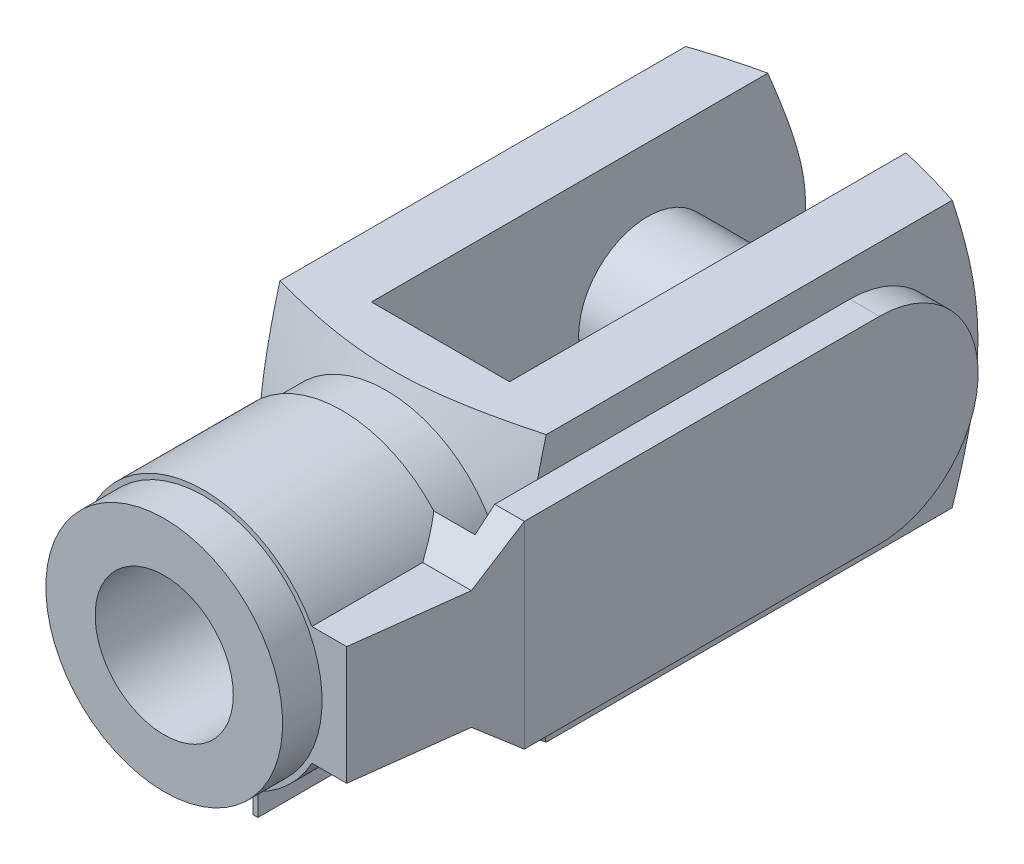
ISO-10303-21;
HEADER;
FILE_DESCRIPTION(('STEP AP214'),'2;1');
FILE_NAME('part.step','',(''),(''),'','','');
FILE_SCHEMA(('AUTOMOTIVE_DESIGN { 1 0 10303 214 1 1 1 1 }'));
ENDSEC;
DATA;
#1=APPLICATION_CONTEXT('core data for automotive mechanical design processes');
#2=APPLICATION_PROTOCOL_DEFINITION('international standard','automotive_design',2000,#1);
#3=PRODUCT_CONTEXT('',#1,'mechanical');
#4=PRODUCT('Part','Part','',(#3));
#5=PRODUCT_RELATED_PRODUCT_CATEGORY('part','',(#4));
#6=PRODUCT_DEFINITION_FORMATION('','',#4);
#7=PRODUCT_DEFINITION_CONTEXT('part definition',#1,'design');
#8=PRODUCT_DEFINITION('design','',#6,#7);
#9=PRODUCT_DEFINITION_SHAPE('','',#8);
#10=(LENGTH_UNIT() NAMED_UNIT(*) SI_UNIT(.MILLI.,.METRE.));
#11=(NAMED_UNIT(*) PLANE_ANGLE_UNIT() SI_UNIT($,.RADIAN.));
#12=(NAMED_UNIT(*) SI_UNIT($,.STERADIAN.) SOLID_ANGLE_UNIT());
#13=UNCERTAINTY_MEASURE_WITH_UNIT(LENGTH_MEASURE(1.E-05),#10,'distance_accuracy_value','');
#14=(GEOMETRIC_REPRESENTATION_CONTEXT(3) GLOBAL_UNCERTAINTY_ASSIGNED_CONTEXT((#13)) GLOBAL_UNIT_ASSIGNED_CONTEXT((#10,
#11,#12)) REPRESENTATION_CONTEXT('',''));
#15=CARTESIAN_POINT('',(0.,0.,0.));
#16=DIRECTION('',(0.,0.,1.));
#17=DIRECTION('',(1.,0.,0.));
#18=AXIS2_PLACEMENT_3D('',#15,#16,#17);
#19=CARTESIAN_POINT('',(16.5000000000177,9.99999999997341,36.0000000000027));
#20=DIRECTION('',(1.76729772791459E-12,1.,2.72158838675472E-13));
#21=DIRECTION('',(1.,-1.76729772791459E-12,0.));
#22=AXIS2_PLACEMENT_3D('',#19,#20,#21);
#23=PLANE('',#22);
#24=DIRECTION('',(0.,2.72158838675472E-13,-1.));
#25=VECTOR('',#24,1.);
#26=CARTESIAN_POINT('',(16.5000000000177,9.99999999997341,36.0000000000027));
#27=LINE('',#26,#25);
#28=CARTESIAN_POINT('',(16.5000000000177,9.99999999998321,2.69922972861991E-12));
#29=VERTEX_POINT('',#28);
#30=CARTESIAN_POINT('',(16.5000000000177,9.99999999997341,36.0000000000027));
#31=VERTEX_POINT('',#30);
#32=EDGE_CURVE('E187',#29,#31,#27,.F.);
#33=ORIENTED_EDGE('',*,*,#32,.F.);
#34=DIRECTION('',(1.,-1.76729772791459E-12,0.));
#35=VECTOR('',#34,1.);
#36=CARTESIAN_POINT('',(16.5000000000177,9.99999999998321,2.69922972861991E-12));
#37=LINE('',#36,#35);
#38=CARTESIAN_POINT('',(13.5000000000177,9.99999999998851,2.69922972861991E-12));
#39=VERTEX_POINT('',#38);
#40=EDGE_CURVE('E196',#29,#39,#37,.F.);
#41=ORIENTED_EDGE('',*,*,#40,.T.);
#42=DIRECTION('',(0.,2.72158838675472E-13,-1.));
#43=VECTOR('',#42,1.);
#44=CARTESIAN_POINT('',(13.5000000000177,10.0000000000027,-51.9999999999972));
#45=LINE('',#44,#43);
#46=CARTESIAN_POINT('',(13.5000000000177,9.9999999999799,31.6573383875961));
#47=VERTEX_POINT('',#46);
#48=EDGE_CURVE('E327',#47,#39,#45,.T.);
#49=ORIENTED_EDGE('',*,*,#48,.F.);
#50=DIRECTION('',(0.,2.72158838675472E-13,-1.));
#51=VECTOR('',#50,1.);
#52=CARTESIAN_POINT('',(13.5000000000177,9.99999999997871,36.0000000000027));
#53=LINE('',#52,#51);
#54=CARTESIAN_POINT('',(13.5000000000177,9.99999999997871,36.0000000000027));
#55=VERTEX_POINT('',#54);
#56=EDGE_CURVE('E202',#47,#55,#53,.F.);
#57=ORIENTED_EDGE('',*,*,#56,.T.);
#58=DIRECTION('',(1.,-1.76729772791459E-12,0.));
#59=VECTOR('',#58,1.);
#60=CARTESIAN_POINT('',(16.5000000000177,9.99999999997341,36.0000000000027));
#61=LINE('',#60,#59);
#62=EDGE_CURVE('E199',#55,#31,#61,.T.);
#63=ORIENTED_EDGE('',*,*,#62,.T.);
#64=EDGE_LOOP('',(#33,#41,#49,#57,#63));
#65=FACE_BOUND('',#64,.T.);
#66=ADVANCED_FACE('F15',(#65),#23,.T.);
#67=CARTESIAN_POINT('',(16.4999999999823,-10.0000000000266,35.9999999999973));
#68=DIRECTION('',(1.,-1.76729772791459E-12,0.));
#69=DIRECTION('',(-1.76729772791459E-12,-1.,-2.72158838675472E-13));
#70=AXIS2_PLACEMENT_3D('',#67,#68,#69);
#71=PLANE('',#70);
#72=CARTESIAN_POINT('',(16.5,-1.67893284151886E-11,0.));
#73=DIRECTION('',(-1.,1.76729772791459E-12,0.));
#74=DIRECTION('',(1.76729772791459E-12,1.,2.72158838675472E-13));
#75=AXIS2_PLACEMENT_3D('',#72,#73,#74);
#76=CIRCLE('',#75,10.);
#77=CARTESIAN_POINT('',(16.4999999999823,-10.0000000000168,-2.69922972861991E-12));
#78=VERTEX_POINT('',#77);
#79=EDGE_CURVE('E191',#78,#29,#76,.F.);
#80=ORIENTED_EDGE('',*,*,#79,.T.);
#81=ORIENTED_EDGE('',*,*,#32,.T.);
#82=DIRECTION('',(-1.76729772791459E-12,-1.,-2.72158838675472E-13));
#83=VECTOR('',#82,1.);
#84=CARTESIAN_POINT('',(16.4999999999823,-10.0000000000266,35.9999999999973));
#85=LINE('',#84,#83);
#86=CARTESIAN_POINT('',(16.4999999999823,-10.0000000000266,35.9999999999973));
#87=VERTEX_POINT('',#86);
#88=EDGE_CURVE('E195',#31,#87,#85,.T.);
#89=ORIENTED_EDGE('',*,*,#88,.T.);
#90=DIRECTION('',(0.,2.72158838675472E-13,-1.));
#91=VECTOR('',#90,1.);
#92=CARTESIAN_POINT('',(16.4999999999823,-10.0000000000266,35.9999999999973));
#93=LINE('',#92,#91);
#94=EDGE_CURVE('E192',#87,#78,#93,.T.);
#95=ORIENTED_EDGE('',*,*,#94,.T.);
#96=EDGE_LOOP('',(#80,#81,#89,#95));
#97=FACE_BOUND('',#96,.T.);
#98=ADVANCED_FACE('F315',(#97),#71,.T.);
#99=CARTESIAN_POINT('',(15.,-1.41383818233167E-11,0.));
#100=DIRECTION('',(-1.,1.76729772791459E-12,0.));
#101=DIRECTION('',(1.76729772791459E-12,1.,2.72158838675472E-13));
#102=AXIS2_PLACEMENT_3D('',#99,#100,#101);
#103=CYLINDRICAL_SURFACE('',#102,10.);
#104=DIRECTION('',(-1.,1.76729772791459E-12,0.));
#105=VECTOR('',#104,1.);
#106=CARTESIAN_POINT('',(14.9999999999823,-10.0000000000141,-2.69922972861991E-12));
#107=LINE('',#106,#105);
#108=CARTESIAN_POINT('',(13.4999999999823,-10.0000000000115,-2.69922972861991E-12));
#109=VERTEX_POINT('',#108);
#110=EDGE_CURVE('E205',#78,#109,#107,.T.);
#111=ORIENTED_EDGE('',*,*,#110,.T.);
#112=CARTESIAN_POINT('',(13.5,-1.14874352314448E-11,0.));
#113=DIRECTION('',(-1.,1.76729772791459E-12,0.));
#114=DIRECTION('',(0.,-2.72158838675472E-13,1.));
#115=AXIS2_PLACEMENT_3D('',#112,#113,#114);
#116=CIRCLE('',#115,10.);
#117=EDGE_CURVE('E324',#39,#109,#116,.T.);
#118=ORIENTED_EDGE('',*,*,#117,.F.);
#119=ORIENTED_EDGE('',*,*,#40,.F.);
#120=ORIENTED_EDGE('',*,*,#79,.F.);
#121=EDGE_LOOP('',(#111,#118,#119,#120));
#122=FACE_BOUND('',#121,.T.);
#123=ADVANCED_FACE('F319',(#122),#103,.T.);
#124=CARTESIAN_POINT('',(13.5000000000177,9.99999999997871,36.0000000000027));
#125=DIRECTION('',(-1.,1.76729772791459E-12,0.));
#126=DIRECTION('',(1.76729772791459E-12,1.,2.72158838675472E-13));
#127=AXIS2_PLACEMENT_3D('',#124,#125,#126);
#128=PLANE('',#127);
#129=CARTESIAN_POINT('',(13.4999999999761,-13.5000000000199,30.7776811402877));
#130=CARTESIAN_POINT('',(13.4999999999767,-13.1776803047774,30.8651609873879));
#131=CARTESIAN_POINT('',(13.4999999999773,-12.8549650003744,30.9511978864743));
#132=CARTESIAN_POINT('',(13.4999999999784,-12.208663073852,31.1199886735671));
#133=CARTESIAN_POINT('',(13.499999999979,-11.8850764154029,31.2027424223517));
#134=CARTESIAN_POINT('',(13.4999999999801,-11.2368014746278,31.3646066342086));
#135=CARTESIAN_POINT('',(13.4999999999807,-10.9121126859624,31.4437150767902));
#136=CARTESIAN_POINT('',(13.4999999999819,-10.2617554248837,31.597770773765));
#137=CARTESIAN_POINT('',(13.4999999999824,-9.93608696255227,31.6727180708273));
#138=CARTESIAN_POINT('',(13.4999999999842,-8.95405542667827,31.8913347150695));
#139=CARTESIAN_POINT('',(13.4999999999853,-8.2960845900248,32.0279142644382));
#140=CARTESIAN_POINT('',(13.4999999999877,-6.97572851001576,32.2774352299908));
#141=CARTESIAN_POINT('',(13.4999999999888,-6.31334391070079,32.3903800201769));
#142=CARTESIAN_POINT('',(13.4999999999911,-5.00268638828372,32.5845628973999));
#143=CARTESIAN_POINT('',(13.4999999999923,-4.35453431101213,32.6665965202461));
#144=CARTESIAN_POINT('',(13.499999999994,-3.37988674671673,32.7656172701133));
#145=CARTESIAN_POINT('',(13.4999999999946,-3.05458885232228,32.7946198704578));
#146=CARTESIAN_POINT('',(13.4999999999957,-2.40335320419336,32.8441493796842));
#147=CARTESIAN_POINT('',(13.4999999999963,-2.07741547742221,32.8646766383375));
#148=CARTESIAN_POINT('',(13.4999999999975,-1.42595363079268,32.8968474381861));
#149=CARTESIAN_POINT('',(13.499999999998,-1.10043065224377,32.908514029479));
#150=CARTESIAN_POINT('',(13.4999999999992,-0.449184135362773,32.9228379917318));
#151=CARTESIAN_POINT('',(13.4999999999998,-0.123460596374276,32.9254953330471));
#152=CARTESIAN_POINT('',(13.5000000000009,0.527924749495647,32.921749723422));
#153=CARTESIAN_POINT('',(13.5000000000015,0.853586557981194,32.9153470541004));
#154=CARTESIAN_POINT('',(13.5000000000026,1.50460157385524,32.8936046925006));
#155=CARTESIAN_POINT('',(13.5000000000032,1.82995478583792,32.8782651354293));
#156=CARTESIAN_POINT('',(13.5000000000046,2.63033395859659,32.8298284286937));
#157=CARTESIAN_POINT('',(13.5000000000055,3.1050672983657,32.7918014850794));
#158=CARTESIAN_POINT('',(13.5000000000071,4.05279477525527,32.6985815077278));
#159=CARTESIAN_POINT('',(13.500000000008,4.52578899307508,32.6433892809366));
#160=CARTESIAN_POINT('',(13.5000000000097,5.47052055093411,32.5174879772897));
#161=CARTESIAN_POINT('',(13.5000000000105,5.94225431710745,32.4467523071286));
#162=CARTESIAN_POINT('',(13.5000000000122,6.88347527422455,32.291728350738));
#163=CARTESIAN_POINT('',(13.500000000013,7.35296244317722,32.2074399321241));
#164=CARTESIAN_POINT('',(13.5000000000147,8.29972673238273,32.0252539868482));
#165=CARTESIAN_POINT('',(13.5000000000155,8.77695480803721,31.9271032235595));
#166=CARTESIAN_POINT('',(13.5000000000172,9.72917052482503,31.7204515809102));
#167=CARTESIAN_POINT('',(13.500000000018,10.2041580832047,31.6119503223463));
#168=CARTESIAN_POINT('',(13.5000000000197,11.1503973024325,31.3866216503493));
#169=CARTESIAN_POINT('',(13.5000000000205,11.6216562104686,31.2698244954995));
#170=CARTESIAN_POINT('',(13.5000000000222,12.5622226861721,31.0289132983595));
#171=CARTESIAN_POINT('',(13.500000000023,13.0315305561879,30.904800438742));
#172=CARTESIAN_POINT('',(13.5000000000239,13.4999999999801,30.777681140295));
#173=B_SPLINE_CURVE_WITH_KNOTS('',3,(#129,#130,#131,#132,#133,#134,#135,#136,#137,#138,#139,
#140,#141,#142,#143,#144,#145,#146,#147,#148,#149,#150,#151,#152,#153,#154,#155,#156,#157,#158,
#159,#160,#161,#162,#163,#164,#165,#166,#167,#168,#169,#170,#171,#172),.UNSPECIFIED.,.F.,.F.,(4,
2,2,2,2,2,2,2,2,2,2,2,2,2,2,2,2,2,2,2,2,4),(0.,1.00194239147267,2.00392722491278,
3.00646090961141,4.00898431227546,6.02460578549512,8.03993932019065,9.99913735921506,
10.9788091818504,11.9584405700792,12.9355147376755,13.9125921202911,14.8896391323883,
15.8666713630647,17.2950713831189,18.7234042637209,20.1542001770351,21.5850100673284,
23.046525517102,24.5080945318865,25.964582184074,27.4208350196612),.UNSPECIFIED.);
#174=CARTESIAN_POINT('',(13.4999999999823,-10.0000000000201,31.6573383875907));
#175=VERTEX_POINT('',#174);
#176=EDGE_CURVE('E604',#175,#47,#173,.T.);
#177=ORIENTED_EDGE('',*,*,#176,.F.);
#178=DIRECTION('',(0.,2.72158838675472E-13,-1.));
#179=VECTOR('',#178,1.);
#180=CARTESIAN_POINT('',(13.4999999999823,-10.0000000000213,35.9999999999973));
#181=LINE('',#180,#179);
#182=CARTESIAN_POINT('',(13.4999999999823,-10.0000000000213,35.9999999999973));
#183=VERTEX_POINT('',#182);
#184=EDGE_CURVE('E211',#183,#175,#181,.T.);
#185=ORIENTED_EDGE('',*,*,#184,.F.);
#186=DIRECTION('',(1.13599708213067E-12,0.642787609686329,0.766044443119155));
#187=VECTOR('',#186,1.);
#188=CARTESIAN_POINT('',(13.4999999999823,-10.0000000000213,35.9999999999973));
#189=LINE('',#188,#187);
#190=CARTESIAN_POINT('',(13.4999999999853,-8.32180073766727,37.9999999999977));
#191=VERTEX_POINT('',#190);
#192=EDGE_CURVE('E231',#183,#191,#189,.T.);
#193=ORIENTED_EDGE('',*,*,#192,.T.);
#194=DIRECTION('',(1.76729772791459E-12,1.,2.72158838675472E-13));
#195=VECTOR('',#194,1.);
#196=CARTESIAN_POINT('',(13.5000000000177,9.99999999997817,38.0000000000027));
#197=LINE('',#196,#195);
#198=CARTESIAN_POINT('',(13.5000000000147,8.32180073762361,38.0000000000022));
#199=VERTEX_POINT('',#198);
#200=EDGE_CURVE('E146',#191,#199,#197,.T.);
#201=ORIENTED_EDGE('',*,*,#200,.T.);
#202=DIRECTION('',(1.13599708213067E-12,0.642787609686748,-0.766044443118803));
#203=VECTOR('',#202,1.);
#204=CARTESIAN_POINT('',(13.5000000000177,9.99999999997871,36.0000000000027));
#205=LINE('',#204,#203);
#206=EDGE_CURVE('E226',#55,#199,#205,.F.);
#207=ORIENTED_EDGE('',*,*,#206,.F.);
#208=ORIENTED_EDGE('',*,*,#56,.F.);
#209=EDGE_LOOP('',(#177,#185,#193,#201,#207,#208));
#210=FACE_BOUND('',#209,.T.);
#211=ADVANCED_FACE('F605',(#210),#128,.T.);
#212=CARTESIAN_POINT('',(16.5000000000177,9.99999999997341,36.0000000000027));
#213=DIRECTION('',(1.35382860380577E-12,0.766044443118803,0.642787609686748));
#214=DIRECTION('',(1.13599708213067E-12,0.642787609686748,-0.766044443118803));
#215=AXIS2_PLACEMENT_3D('',#212,#213,#214);
#216=PLANE('',#215);
#217=DIRECTION('',(0.0953195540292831,0.639860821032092,-0.762556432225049));
#218=VECTOR('',#217,1.);
#219=CARTESIAN_POINT('',(15.9041232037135,5.99999999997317,40.7670143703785));
#220=LINE('',#219,#218);
#221=CARTESIAN_POINT('',(15.9041232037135,5.99999999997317,40.7670143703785));
#222=VERTEX_POINT('',#221);
#223=EDGE_CURVE('E212',#222,#31,#220,.T.);
#224=ORIENTED_EDGE('',*,*,#223,.T.);
#225=ORIENTED_EDGE('',*,*,#62,.F.);
#226=ORIENTED_EDGE('',*,*,#206,.T.);
#227=DIRECTION('',(-1.,1.76729772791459E-12,0.));
#228=VECTOR('',#227,1.);
#229=CARTESIAN_POINT('',(16.5000000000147,8.32180073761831,38.0000000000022));
#230=LINE('',#229,#228);
#231=CARTESIAN_POINT('',(9.3272521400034,8.32180073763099,38.0000000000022));
#232=VERTEX_POINT('',#231);
#233=EDGE_CURVE('E223',#199,#232,#230,.T.);
#234=ORIENTED_EDGE('',*,*,#233,.T.);
#235=CARTESIAN_POINT('',(0.,-6.75425904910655E-13,47.9175359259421));
#236=DIRECTION('',(1.35382860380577E-12,0.766044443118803,0.642787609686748));
#237=DIRECTION('',(1.13599708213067E-12,0.642787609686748,-0.766044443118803));
#238=AXIS2_PLACEMENT_3D('',#235,#236,#237);
#239=ELLIPSE('',#238,19.4465478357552,12.5);
#240=CARTESIAN_POINT('',(10.9658560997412,5.99999999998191,40.7670143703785));
#241=VERTEX_POINT('',#240);
#242=EDGE_CURVE('E222',#232,#241,#239,.F.);
#243=ORIENTED_EDGE('',*,*,#242,.T.);
#244=DIRECTION('',(-1.,1.76729772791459E-12,0.));
#245=VECTOR('',#244,1.);
#246=CARTESIAN_POINT('',(16.5000000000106,5.99999999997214,40.7670143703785));
#247=LINE('',#246,#245);
#248=EDGE_CURVE('E218',#241,#222,#247,.F.);
#249=ORIENTED_EDGE('',*,*,#248,.T.);
#250=EDGE_LOOP('',(#224,#225,#226,#234,#243,#249));
#251=FACE_BOUND('',#250,.T.);
#252=ADVANCED_FACE('F292',(#251),#216,.T.);
#253=CARTESIAN_POINT('',(13.4999999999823,-10.0000000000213,35.9999999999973));
#254=DIRECTION('',(-1.76729772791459E-12,-1.,-2.72158838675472E-13));
#255=DIRECTION('',(-1.,1.76729772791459E-12,0.));
#256=AXIS2_PLACEMENT_3D('',#253,#254,#255);
#257=PLANE('',#256);
#258=ORIENTED_EDGE('',*,*,#94,.F.);
#259=DIRECTION('',(-1.,1.76729772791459E-12,0.));
#260=VECTOR('',#259,1.);
#261=CARTESIAN_POINT('',(13.4999999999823,-10.0000000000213,35.9999999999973));
#262=LINE('',#261,#260);
#263=EDGE_CURVE('E208',#87,#183,#262,.T.);
#264=ORIENTED_EDGE('',*,*,#263,.T.);
#265=ORIENTED_EDGE('',*,*,#184,.T.);
#266=DIRECTION('',(0.,-2.72158838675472E-13,1.));
#267=VECTOR('',#266,1.);
#268=CARTESIAN_POINT('',(13.4999999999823,-9.99999999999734,-52.0000000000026));
#269=LINE('',#268,#267);
#270=EDGE_CURVE('E183',#109,#175,#269,.T.);
#271=ORIENTED_EDGE('',*,*,#270,.F.);
#272=ORIENTED_EDGE('',*,*,#110,.F.);
#273=EDGE_LOOP('',(#258,#264,#265,#271,#272));
#274=FACE_BOUND('',#273,.T.);
#275=ADVANCED_FACE('F357',(#274),#257,.T.);
#276=CARTESIAN_POINT('',(16.4999999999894,-6.00000000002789,40.7670143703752));
#277=DIRECTION('',(-1.35382860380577E-12,-0.766044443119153,0.642787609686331));
#278=DIRECTION('',(1.13599708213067E-12,0.642787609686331,0.766044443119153));
#279=AXIS2_PLACEMENT_3D('',#276,#277,#278);
#280=PLANE('',#279);
#281=CARTESIAN_POINT('',(0.,-6.7542590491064E-13,47.9175359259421));
#282=DIRECTION('',(-1.35382860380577E-12,-0.766044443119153,0.642787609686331));
#283=DIRECTION('',(-1.13599708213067E-12,-0.642787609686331,-0.766044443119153));
#284=AXIS2_PLACEMENT_3D('',#281,#282,#283);
#285=ELLIPSE('',#284,19.4465478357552,12.5);
#286=CARTESIAN_POINT('',(10.96585609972,-6.0000000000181,40.7670143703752));
#287=VERTEX_POINT('',#286);
#288=CARTESIAN_POINT('',(9.32725213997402,-8.32180073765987,37.9999999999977));
#289=VERTEX_POINT('',#288);
#290=EDGE_CURVE('E133',#287,#289,#285,.F.);
#291=ORIENTED_EDGE('',*,*,#290,.T.);
#292=DIRECTION('',(-1.,1.76729772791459E-12,0.));
#293=VECTOR('',#292,1.);
#294=CARTESIAN_POINT('',(16.4999999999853,-8.32180073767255,37.9999999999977));
#295=LINE('',#294,#293);
#296=EDGE_CURVE('E143',#289,#191,#295,.F.);
#297=ORIENTED_EDGE('',*,*,#296,.T.);
#298=ORIENTED_EDGE('',*,*,#192,.F.);
#299=ORIENTED_EDGE('',*,*,#263,.F.);
#300=DIRECTION('',(-0.0953195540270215,0.639860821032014,0.762556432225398));
#301=VECTOR('',#300,1.);
#302=CARTESIAN_POINT('',(16.4999999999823,-10.0000000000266,35.9999999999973));
#303=LINE('',#302,#301);
#304=CARTESIAN_POINT('',(15.9041232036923,-6.00000000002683,40.7670143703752));
#305=VERTEX_POINT('',#304);
#306=EDGE_CURVE('E215',#87,#305,#303,.T.);
#307=ORIENTED_EDGE('',*,*,#306,.T.);
#308=DIRECTION('',(-1.,1.76729772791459E-12,0.));
#309=VECTOR('',#308,1.);
#310=CARTESIAN_POINT('',(16.4999999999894,-6.00000000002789,40.7670143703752));
#311=LINE('',#310,#309);
#312=EDGE_CURVE('E153',#305,#287,#311,.T.);
#313=ORIENTED_EDGE('',*,*,#312,.T.);
#314=EDGE_LOOP('',(#291,#297,#298,#299,#307,#313));
#315=FACE_BOUND('',#314,.T.);
#316=ADVANCED_FACE('F151',(#315),#280,.T.);
#317=CARTESIAN_POINT('',(-0.5,2.91269708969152E-12,38.));
#318=DIRECTION('',(0.,2.72158838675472E-13,-1.));
#319=DIRECTION('',(-1.,1.76729772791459E-12,0.));
#320=AXIS2_PLACEMENT_3D('',#317,#318,#319);
#321=PLANE('',#320);
#322=ORIENTED_EDGE('',*,*,#200,.F.);
#323=ORIENTED_EDGE('',*,*,#296,.F.);
#324=CARTESIAN_POINT('',(0.,2.02371915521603E-12,38.));
#325=DIRECTION('',(0.,2.72158838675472E-13,-1.));
#326=DIRECTION('',(-1.,1.76729772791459E-12,0.));
#327=AXIS2_PLACEMENT_3D('',#324,#325,#326);
#328=CIRCLE('',#327,12.5);
#329=CARTESIAN_POINT('',(5.49999999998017,-11.2249721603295,37.9999999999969));
#330=VERTEX_POINT('',#329);
#331=EDGE_CURVE('E129',#289,#330,#328,.T.);
#332=ORIENTED_EDGE('',*,*,#331,.T.);
#333=DIRECTION('',(1.76729772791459E-12,1.,2.72158838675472E-13));
#334=VECTOR('',#333,1.);
#335=CARTESIAN_POINT('',(5.5,-7.69108927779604E-12,38.));
#336=LINE('',#335,#334);
#337=CARTESIAN_POINT('',(5.49999999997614,-13.5000000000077,37.9999999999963));
#338=VERTEX_POINT('',#337);
#339=EDGE_CURVE('E140',#330,#338,#336,.F.);
#340=ORIENTED_EDGE('',*,*,#339,.T.);
#341=DIRECTION('',(-1.,1.76729772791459E-12,0.));
#342=VECTOR('',#341,1.);
#343=CARTESIAN_POINT('',(5.49999999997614,-13.5000000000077,37.9999999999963));
#344=LINE('',#343,#342);
#345=CARTESIAN_POINT('',(4.99999999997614,-13.5000000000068,37.9999999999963));
#346=VERTEX_POINT('',#345);
#347=EDGE_CURVE('E280',#346,#338,#344,.F.);
#348=ORIENTED_EDGE('',*,*,#347,.F.);
#349=DIRECTION('',(1.76729772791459E-12,1.,2.72158838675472E-13));
#350=VECTOR('',#349,1.);
#351=CARTESIAN_POINT('',(5.,-6.80744041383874E-12,38.));
#352=LINE('',#351,#350);
#353=CARTESIAN_POINT('',(4.99999999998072,-10.9087121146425,37.9999999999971));
#354=VERTEX_POINT('',#353);
#355=EDGE_CURVE('E257',#346,#354,#352,.T.);
#356=ORIENTED_EDGE('',*,*,#355,.T.);
#357=CARTESIAN_POINT('',(0.,2.03260093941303E-12,38.));
#358=DIRECTION('',(0.,2.72158838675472E-13,-1.));
#359=DIRECTION('',(-1.,1.76729772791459E-12,0.));
#360=AXIS2_PLACEMENT_3D('',#357,#358,#359);
#361=CIRCLE('',#360,12.);
#362=CARTESIAN_POINT('',(-6.00000000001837,-10.3923048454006,37.9999999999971));
#363=VERTEX_POINT('',#362);
#364=EDGE_CURVE('E25',#354,#363,#361,.F.);
#365=ORIENTED_EDGE('',*,*,#364,.T.);
#366=DIRECTION('',(1.76729772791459E-12,1.,2.72158838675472E-13));
#367=VECTOR('',#366,1.);
#368=CARTESIAN_POINT('',(-6.,1.26328345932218E-11,38.));
#369=LINE('',#368,#367);
#370=CARTESIAN_POINT('',(-6.00000000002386,-13.4999999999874,37.9999999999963));
#371=VERTEX_POINT('',#370);
#372=EDGE_CURVE('E255',#363,#371,#369,.F.);
#373=ORIENTED_EDGE('',*,*,#372,.T.);
#374=DIRECTION('',(-1.,1.78150858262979E-12,0.));
#375=VECTOR('',#374,1.);
#376=CARTESIAN_POINT('',(-6.00000000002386,-13.4999999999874,37.9999999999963));
#377=LINE('',#376,#375);
#378=CARTESIAN_POINT('',(-6.50000000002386,-13.4999999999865,37.9999999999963));
#379=VERTEX_POINT('',#378);
#380=EDGE_CURVE('E284',#379,#371,#377,.F.);
#381=ORIENTED_EDGE('',*,*,#380,.F.);
#382=DIRECTION('',(1.76729772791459E-12,1.,2.72158838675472E-13));
#383=VECTOR('',#382,1.);
#384=CARTESIAN_POINT('',(-6.5,1.35164834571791E-11,38.));
#385=LINE('',#384,#383);
#386=CARTESIAN_POINT('',(-6.50000000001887,-10.6770782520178,37.9999999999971));
#387=VERTEX_POINT('',#386);
#388=EDGE_CURVE('E170',#379,#387,#385,.T.);
#389=ORIENTED_EDGE('',*,*,#388,.T.);
#390=CARTESIAN_POINT('',(0.,2.02371915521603E-12,38.));
#391=DIRECTION('',(0.,2.72158838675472E-13,-1.));
#392=DIRECTION('',(-1.,1.76729772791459E-12,0.));
#393=AXIS2_PLACEMENT_3D('',#390,#391,#392);
#394=CIRCLE('',#393,12.5);
#395=EDGE_CURVE('E167',#232,#387,#394,.F.);
#396=ORIENTED_EDGE('',*,*,#395,.F.);
#397=ORIENTED_EDGE('',*,*,#233,.F.);
#398=EDGE_LOOP('',(#322,#323,#332,#340,#348,#356,#365,#373,#381,#389,#396,#397));
#399=FACE_BOUND('',#398,.T.);
#400=ADVANCED_FACE('F144',(#399),#321,.T.);
#401=CARTESIAN_POINT('',(-0.5,-8.97526651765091E-13,52.));
#402=DIRECTION('',(0.,2.72158838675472E-13,-1.));
#403=DIRECTION('',(-1.,1.76729772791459E-12,0.));
#404=AXIS2_PLACEMENT_3D('',#401,#402,#403);
#405=PLANE('',#404);
#406=DIRECTION('',(1.76729772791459E-12,1.,2.72158838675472E-13));
#407=VECTOR('',#406,1.);
#408=CARTESIAN_POINT('',(5.,-1.06176641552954E-11,52.));
#409=LINE('',#408,#407);
#410=CARTESIAN_POINT('',(4.99999999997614,-13.5000000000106,51.9999999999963));
#411=VERTEX_POINT('',#410);
#412=CARTESIAN_POINT('',(4.99999999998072,-10.9087121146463,51.999999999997));
#413=VERTEX_POINT('',#412);
#414=EDGE_CURVE('E239',#411,#413,#409,.T.);
#415=ORIENTED_EDGE('',*,*,#414,.F.);
#416=DIRECTION('',(-1.,1.76729772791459E-12,0.));
#417=VECTOR('',#416,1.);
#418=CARTESIAN_POINT('',(5.49999999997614,-13.5000000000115,51.9999999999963));
#419=LINE('',#418,#417);
#420=CARTESIAN_POINT('',(5.49999999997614,-13.5000000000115,51.9999999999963));
#421=VERTEX_POINT('',#420);
#422=EDGE_CURVE('E282',#421,#411,#419,.T.);
#423=ORIENTED_EDGE('',*,*,#422,.F.);
#424=DIRECTION('',(1.76729772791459E-12,1.,2.72158838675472E-13));
#425=VECTOR('',#424,1.);
#426=CARTESIAN_POINT('',(5.5,-1.15013130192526E-11,52.));
#427=LINE('',#426,#425);
#428=CARTESIAN_POINT('',(5.49999999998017,-11.2249721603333,51.9999999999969));
#429=VERTEX_POINT('',#428);
#430=EDGE_CURVE('E162',#429,#421,#427,.F.);
#431=ORIENTED_EDGE('',*,*,#430,.F.);
#432=CARTESIAN_POINT('',(0.,-1.78650458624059E-12,52.));
#433=DIRECTION('',(0.,2.72158838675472E-13,-1.));
#434=DIRECTION('',(-1.,1.76729772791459E-12,0.));
#435=AXIS2_PLACEMENT_3D('',#432,#433,#434);
#436=CIRCLE('',#435,12.5);
#437=CARTESIAN_POINT('',(10.96585609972,-6.00000000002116,51.9999999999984));
#438=VERTEX_POINT('',#437);
#439=EDGE_CURVE('E160',#438,#429,#436,.T.);
#440=ORIENTED_EDGE('',*,*,#439,.F.);
#441=DIRECTION('',(-1.,1.76729772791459E-12,0.));
#442=VECTOR('',#441,1.);
#443=CARTESIAN_POINT('',(-0.500000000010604,-6.0000000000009,51.9999999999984));
#444=LINE('',#443,#442);
#445=CARTESIAN_POINT('',(14.4999999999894,-6.00000000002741,51.9999999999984));
#446=VERTEX_POINT('',#445);
#447=EDGE_CURVE('E163',#446,#438,#444,.T.);
#448=ORIENTED_EDGE('',*,*,#447,.F.);
#449=DIRECTION('',(1.76729772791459E-12,1.,2.72158838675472E-13));
#450=VECTOR('',#449,1.);
#451=CARTESIAN_POINT('',(14.5000000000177,9.99999999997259,52.0000000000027));
#452=LINE('',#451,#450);
#453=CARTESIAN_POINT('',(14.5000000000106,5.99999999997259,52.0000000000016));
#454=VERTEX_POINT('',#453);
#455=EDGE_CURVE('E234',#446,#454,#452,.T.);
#456=ORIENTED_EDGE('',*,*,#455,.T.);
#457=DIRECTION('',(1.,-1.76729772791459E-12,0.));
#458=VECTOR('',#457,1.);
#459=CARTESIAN_POINT('',(16.5000000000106,5.99999999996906,52.0000000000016));
#460=LINE('',#459,#458);
#461=CARTESIAN_POINT('',(10.9658560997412,5.99999999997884,52.0000000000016));
#462=VERTEX_POINT('',#461);
#463=EDGE_CURVE('E155',#462,#454,#460,.T.);
#464=ORIENTED_EDGE('',*,*,#463,.F.);
#465=CARTESIAN_POINT('',(0.,-1.78650458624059E-12,52.));
#466=DIRECTION('',(0.,2.72158838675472E-13,-1.));
#467=DIRECTION('',(-1.,1.76729772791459E-12,0.));
#468=AXIS2_PLACEMENT_3D('',#465,#466,#467);
#469=CIRCLE('',#468,12.5);
#470=CARTESIAN_POINT('',(-6.50000000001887,-10.6770782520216,51.9999999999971));
#471=VERTEX_POINT('',#470);
#472=EDGE_CURVE('E164',#471,#462,#469,.T.);
#473=ORIENTED_EDGE('',*,*,#472,.F.);
#474=DIRECTION('',(1.76729772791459E-12,1.,2.72158838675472E-13));
#475=VECTOR('',#474,1.);
#476=CARTESIAN_POINT('',(-6.5,9.70625971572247E-12,52.));
#477=LINE('',#476,#475);
#478=CARTESIAN_POINT('',(-6.50000000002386,-13.4999999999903,51.9999999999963));
#479=VERTEX_POINT('',#478);
#480=EDGE_CURVE('E166',#479,#471,#477,.T.);
#481=ORIENTED_EDGE('',*,*,#480,.F.);
#482=DIRECTION('',(-1.,1.78150858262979E-12,0.));
#483=VECTOR('',#482,1.);
#484=CARTESIAN_POINT('',(-6.00000000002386,-13.4999999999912,51.9999999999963));
#485=LINE('',#484,#483);
#486=CARTESIAN_POINT('',(-6.00000000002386,-13.4999999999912,51.9999999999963));
#487=VERTEX_POINT('',#486);
#488=EDGE_CURVE('E286',#487,#479,#485,.T.);
#489=ORIENTED_EDGE('',*,*,#488,.F.);
#490=DIRECTION('',(1.76729772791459E-12,1.,2.72158838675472E-13));
#491=VECTOR('',#490,1.);
#492=CARTESIAN_POINT('',(-6.,8.82261085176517E-12,52.));
#493=LINE('',#492,#491);
#494=CARTESIAN_POINT('',(-6.00000000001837,-10.3923048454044,51.9999999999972));
#495=VERTEX_POINT('',#494);
#496=EDGE_CURVE('E248',#495,#487,#493,.F.);
#497=ORIENTED_EDGE('',*,*,#496,.F.);
#498=CARTESIAN_POINT('',(0.,-1.78331935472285E-12,52.));
#499=DIRECTION('',(0.,2.72158838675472E-13,-1.));
#500=DIRECTION('',(-1.,1.76729772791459E-12,0.));
#501=AXIS2_PLACEMENT_3D('',#498,#499,#500);
#502=CIRCLE('',#501,12.);
#503=EDGE_CURVE('E176',#413,#495,#502,.F.);
#504=ORIENTED_EDGE('',*,*,#503,.F.);
#505=EDGE_LOOP('',(#415,#423,#431,#440,#448,#456,#464,#473,#481,#489,#497,#504));
#506=FACE_BOUND('',#505,.T.);
#507=ADVANCED_FACE('F341',(#506),#405,.F.);
#508=CARTESIAN_POINT('',(4.99999999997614,-13.5000000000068,37.9999999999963));
#509=DIRECTION('',(-1.,1.76729772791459E-12,0.));
#510=DIRECTION('',(1.76729772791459E-12,1.,2.72158838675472E-13));
#511=AXIS2_PLACEMENT_3D('',#508,#509,#510);
#512=PLANE('',#511);
#513=ORIENTED_EDGE('',*,*,#355,.F.);
#514=DIRECTION('',(0.,2.72158838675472E-13,-1.));
#515=VECTOR('',#514,1.);
#516=CARTESIAN_POINT('',(4.99999999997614,-13.5000000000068,37.9999999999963));
#517=LINE('',#516,#515);
#518=EDGE_CURVE('E262',#346,#411,#517,.F.);
#519=ORIENTED_EDGE('',*,*,#518,.T.);
#520=ORIENTED_EDGE('',*,*,#414,.T.);
#521=DIRECTION('',(0.,2.72158838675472E-13,-1.));
#522=VECTOR('',#521,1.);
#523=CARTESIAN_POINT('',(4.99999999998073,-10.9087121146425,37.9999999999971));
#524=LINE('',#523,#522);
#525=EDGE_CURVE('E9',#413,#354,#524,.T.);
#526=ORIENTED_EDGE('',*,*,#525,.T.);
#527=EDGE_LOOP('',(#513,#519,#520,#526));
#528=FACE_BOUND('',#527,.T.);
#529=ADVANCED_FACE('F700',(#528),#512,.T.);
#530=CARTESIAN_POINT('',(5.49999999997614,-13.5000000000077,37.9999999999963));
#531=DIRECTION('',(-1.76729772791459E-12,-1.,-2.72158838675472E-13));
#532=DIRECTION('',(-1.,1.76729772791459E-12,0.));
#533=AXIS2_PLACEMENT_3D('',#530,#531,#532);
#534=PLANE('',#533);
#535=ORIENTED_EDGE('',*,*,#347,.T.);
#536=DIRECTION('',(0.,2.72158838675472E-13,-1.));
#537=VECTOR('',#536,1.);
#538=CARTESIAN_POINT('',(5.49999999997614,-13.5000000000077,37.9999999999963));
#539=LINE('',#538,#537);
#540=EDGE_CURVE('E265',#421,#338,#539,.T.);
#541=ORIENTED_EDGE('',*,*,#540,.F.);
#542=ORIENTED_EDGE('',*,*,#422,.T.);
#543=ORIENTED_EDGE('',*,*,#518,.F.);
#544=EDGE_LOOP('',(#535,#541,#542,#543));
#545=FACE_BOUND('',#544,.T.);
#546=ADVANCED_FACE('F697',(#545),#534,.T.);
#547=CARTESIAN_POINT('',(5.49999999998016,-11.2249721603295,37.9999999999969));
#548=DIRECTION('',(1.,-1.76729772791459E-12,0.));
#549=DIRECTION('',(-1.76729772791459E-12,-1.,-2.72158838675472E-13));
#550=AXIS2_PLACEMENT_3D('',#547,#548,#549);
#551=PLANE('',#550);
#552=ORIENTED_EDGE('',*,*,#339,.F.);
#553=DIRECTION('',(0.,2.72158838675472E-13,-1.));
#554=VECTOR('',#553,1.);
#555=CARTESIAN_POINT('',(5.49999999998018,-11.2249721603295,37.9999999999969));
#556=LINE('',#555,#554);
#557=EDGE_CURVE('E136',#429,#330,#556,.T.);
#558=ORIENTED_EDGE('',*,*,#557,.F.);
#559=ORIENTED_EDGE('',*,*,#430,.T.);
#560=ORIENTED_EDGE('',*,*,#540,.T.);
#561=EDGE_LOOP('',(#552,#558,#559,#560));
#562=FACE_BOUND('',#561,.T.);
#563=ADVANCED_FACE('F699',(#562),#551,.T.);
#564=CARTESIAN_POINT('',(0.,2.02371915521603E-12,38.));
#565=DIRECTION('',(0.,2.72158838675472E-13,-1.));
#566=DIRECTION('',(-1.,1.76729772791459E-12,0.));
#567=AXIS2_PLACEMENT_3D('',#564,#565,#566);
#568=CYLINDRICAL_SURFACE('',#567,12.5);
#569=ORIENTED_EDGE('',*,*,#331,.F.);
#570=ORIENTED_EDGE('',*,*,#290,.F.);
#571=DIRECTION('',(0.,2.72158838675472E-13,-1.));
#572=VECTOR('',#571,1.);
#573=CARTESIAN_POINT('',(10.96585609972,-6.00000000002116,51.9999999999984));
#574=LINE('',#573,#572);
#575=EDGE_CURVE('E169',#438,#287,#574,.T.);
#576=ORIENTED_EDGE('',*,*,#575,.F.);
#577=ORIENTED_EDGE('',*,*,#439,.T.);
#578=ORIENTED_EDGE('',*,*,#557,.T.);
#579=EDGE_LOOP('',(#569,#570,#576,#577,#578));
#580=FACE_BOUND('',#579,.T.);
#581=ADVANCED_FACE('F131',(#580),#568,.T.);
#582=CARTESIAN_POINT('',(16.4999999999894,-6.00000000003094,51.9999999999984));
#583=DIRECTION('',(-1.76729772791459E-12,-1.,-2.72158838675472E-13));
#584=DIRECTION('',(-1.,1.76729772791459E-12,0.));
#585=AXIS2_PLACEMENT_3D('',#582,#583,#584);
#586=PLANE('',#585);
#587=ORIENTED_EDGE('',*,*,#575,.T.);
#588=ORIENTED_EDGE('',*,*,#312,.F.);
#589=DIRECTION('',(-0.124034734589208,0.,0.992277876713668));
#590=VECTOR('',#589,1.);
#591=CARTESIAN_POINT('',(16.4999999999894,-6.00000000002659,35.9999999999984));
#592=LINE('',#591,#590);
#593=EDGE_CURVE('E217',#305,#446,#592,.T.);
#594=ORIENTED_EDGE('',*,*,#593,.T.);
#595=ORIENTED_EDGE('',*,*,#447,.T.);
#596=EDGE_LOOP('',(#587,#588,#594,#595));
#597=FACE_BOUND('',#596,.T.);
#598=ADVANCED_FACE('F355',(#597),#586,.T.);
#599=CARTESIAN_POINT('',(16.5000000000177,9.99999999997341,36.0000000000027));
#600=DIRECTION('',(-0.992277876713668,1.7874075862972E-12,-0.124034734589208));
#601=DIRECTION('',(-0.124034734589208,0.,0.992277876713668));
#602=AXIS2_PLACEMENT_3D('',#599,#600,#601);
#603=PLANE('',#602);
#604=DIRECTION('',(-0.124034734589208,0.,0.992277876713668));
#605=VECTOR('',#604,1.);
#606=CARTESIAN_POINT('',(16.5000000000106,5.99999999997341,36.0000000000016));
#607=LINE('',#606,#605);
#608=EDGE_CURVE('E214',#454,#222,#607,.F.);
#609=ORIENTED_EDGE('',*,*,#608,.F.);
#610=ORIENTED_EDGE('',*,*,#455,.F.);
#611=ORIENTED_EDGE('',*,*,#593,.F.);
#612=ORIENTED_EDGE('',*,*,#306,.F.);
#613=ORIENTED_EDGE('',*,*,#88,.F.);
#614=ORIENTED_EDGE('',*,*,#223,.F.);
#615=EDGE_LOOP('',(#609,#610,#611,#612,#613,#614));
#616=FACE_BOUND('',#615,.T.);
#617=ADVANCED_FACE('F304',(#616),#603,.F.);
#618=CARTESIAN_POINT('',(16.5000000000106,5.99999999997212,40.7670143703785));
#619=DIRECTION('',(1.76729772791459E-12,1.,2.72158838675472E-13));
#620=DIRECTION('',(1.,-1.76729772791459E-12,0.));
#621=AXIS2_PLACEMENT_3D('',#618,#619,#620);
#622=PLANE('',#621);
#623=DIRECTION('',(0.,2.72158838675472E-13,-1.));
#624=VECTOR('',#623,1.);
#625=CARTESIAN_POINT('',(10.9658560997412,5.9999999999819,40.7670143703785));
#626=LINE('',#625,#624);
#627=EDGE_CURVE('E237',#241,#462,#626,.F.);
#628=ORIENTED_EDGE('',*,*,#627,.T.);
#629=ORIENTED_EDGE('',*,*,#463,.T.);
#630=ORIENTED_EDGE('',*,*,#608,.T.);
#631=ORIENTED_EDGE('',*,*,#248,.F.);
#632=EDGE_LOOP('',(#628,#629,#630,#631));
#633=FACE_BOUND('',#632,.T.);
#634=ADVANCED_FACE('F300',(#633),#622,.T.);
#635=CARTESIAN_POINT('',(0.,2.02371915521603E-12,38.));
#636=DIRECTION('',(0.,2.72158838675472E-13,-1.));
#637=DIRECTION('',(-1.,1.76729772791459E-12,0.));
#638=AXIS2_PLACEMENT_3D('',#635,#636,#637);
#639=CYLINDRICAL_SURFACE('',#638,12.5);
#640=DIRECTION('',(0.,2.72158838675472E-13,-1.));
#641=VECTOR('',#640,1.);
#642=CARTESIAN_POINT('',(-6.50000000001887,-10.6770782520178,37.9999999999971));
#643=LINE('',#642,#641);
#644=EDGE_CURVE('E268',#387,#471,#643,.F.);
#645=ORIENTED_EDGE('',*,*,#644,.T.);
#646=ORIENTED_EDGE('',*,*,#472,.T.);
#647=ORIENTED_EDGE('',*,*,#627,.F.);
#648=ORIENTED_EDGE('',*,*,#242,.F.);
#649=ORIENTED_EDGE('',*,*,#395,.T.);
#650=EDGE_LOOP('',(#645,#646,#647,#648,#649));
#651=FACE_BOUND('',#650,.T.);
#652=ADVANCED_FACE('F296',(#651),#639,.T.);
#653=CARTESIAN_POINT('',(-6.50000000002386,-13.4999999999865,37.9999999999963));
#654=DIRECTION('',(-1.,1.76729772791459E-12,0.));
#655=DIRECTION('',(1.76729772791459E-12,1.,2.72158838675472E-13));
#656=AXIS2_PLACEMENT_3D('',#653,#654,#655);
#657=PLANE('',#656);
#658=ORIENTED_EDGE('',*,*,#388,.F.);
#659=DIRECTION('',(0.,2.72158838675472E-13,-1.));
#660=VECTOR('',#659,1.);
#661=CARTESIAN_POINT('',(-6.50000000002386,-13.4999999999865,37.9999999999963));
#662=LINE('',#661,#660);
#663=EDGE_CURVE('E272',#379,#479,#662,.F.);
#664=ORIENTED_EDGE('',*,*,#663,.T.);
#665=ORIENTED_EDGE('',*,*,#480,.T.);
#666=ORIENTED_EDGE('',*,*,#644,.F.);
#667=EDGE_LOOP('',(#658,#664,#665,#666));
#668=FACE_BOUND('',#667,.T.);
#669=ADVANCED_FACE('F350',(#668),#657,.T.);
#670=CARTESIAN_POINT('',(-6.00000000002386,-13.4999999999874,37.9999999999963));
#671=DIRECTION('',(-1.78150858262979E-12,-1.,-2.72158838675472E-13));
#672=DIRECTION('',(-1.,1.78150858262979E-12,0.));
#673=AXIS2_PLACEMENT_3D('',#670,#671,#672);
#674=PLANE('',#673);
#675=ORIENTED_EDGE('',*,*,#380,.T.);
#676=DIRECTION('',(0.,2.72158838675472E-13,-1.));
#677=VECTOR('',#676,1.);
#678=CARTESIAN_POINT('',(-6.00000000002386,-13.4999999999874,37.9999999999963));
#679=LINE('',#678,#677);
#680=EDGE_CURVE('E275',#487,#371,#679,.T.);
#681=ORIENTED_EDGE('',*,*,#680,.F.);
#682=ORIENTED_EDGE('',*,*,#488,.T.);
#683=ORIENTED_EDGE('',*,*,#663,.F.);
#684=EDGE_LOOP('',(#675,#681,#682,#683));
#685=FACE_BOUND('',#684,.T.);
#686=ADVANCED_FACE('F348',(#685),#674,.T.);
#687=CARTESIAN_POINT('',(-6.00000000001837,-10.3923048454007,37.9999999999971));
#688=DIRECTION('',(1.,-1.76729772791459E-12,0.));
#689=DIRECTION('',(-1.76729772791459E-12,-1.,-2.72158838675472E-13));
#690=AXIS2_PLACEMENT_3D('',#687,#688,#689);
#691=PLANE('',#690);
#692=ORIENTED_EDGE('',*,*,#372,.F.);
#693=DIRECTION('',(0.,-2.72130476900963E-13,1.));
#694=VECTOR('',#693,1.);
#695=CARTESIAN_POINT('',(-6.00000000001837,-10.3923048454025,44.7499999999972));
#696=LINE('',#695,#694);
#697=EDGE_CURVE('E171',#363,#495,#696,.T.);
#698=ORIENTED_EDGE('',*,*,#697,.T.);
#699=ORIENTED_EDGE('',*,*,#496,.T.);
#700=ORIENTED_EDGE('',*,*,#680,.T.);
#701=EDGE_LOOP('',(#692,#698,#699,#700));
#702=FACE_BOUND('',#701,.T.);
#703=ADVANCED_FACE('F344',(#702),#691,.T.);
#704=CARTESIAN_POINT('',(-1.25,1.45802062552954E-11,0.));
#705=DIRECTION('',(-1.,1.76729772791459E-12,0.));
#706=DIRECTION('',(1.76729772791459E-12,1.,2.72158838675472E-13));
#707=AXIS2_PLACEMENT_3D('',#704,#705,#706);
#708=CYLINDRICAL_SURFACE('',#707,7.);
#709=CARTESIAN_POINT('',(7.,0.,0.));
#710=DIRECTION('',(1.,-1.76729772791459E-12,0.));
#711=DIRECTION('',(-1.76729772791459E-12,-1.,-2.72158838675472E-13));
#712=AXIS2_PLACEMENT_3D('',#709,#710,#711);
#713=CIRCLE('',#712,7.);
#714=CARTESIAN_POINT('',(6.99999999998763,-7.,-1.90511187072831E-12));
#715=VERTEX_POINT('',#714);
#716=EDGE_CURVE('E376',#715,#715,#713,.F.);
#717=ORIENTED_EDGE('',*,*,#716,.T.);
#718=EDGE_LOOP('',(#717));
#719=FACE_BOUND('',#718,.T.);
#720=CARTESIAN_POINT('',(-7.,2.47415558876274E-11,0.));
#721=DIRECTION('',(1.,-1.76729772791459E-12,0.));
#722=DIRECTION('',(-1.76729772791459E-12,-1.,-2.72158838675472E-13));
#723=AXIS2_PLACEMENT_3D('',#720,#721,#722);
#724=CIRCLE('',#723,7.);
#725=CARTESIAN_POINT('',(-7.00000000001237,-6.99999999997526,-1.90511187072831E-12));
#726=VERTEX_POINT('',#725);
#727=EDGE_CURVE('E535',#726,#726,#724,.T.);
#728=ORIENTED_EDGE('',*,*,#727,.T.);
#729=EDGE_LOOP('',(#728));
#730=FACE_BOUND('',#729,.T.);
#731=ADVANCED_FACE('F689',(#719,#730),#708,.T.);
#732=CARTESIAN_POINT('',(-13.,3.5345342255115E-11,0.));
#733=DIRECTION('',(-1.,1.76729772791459E-12,0.));
#734=DIRECTION('',(0.,2.71913917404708E-13,-1.));
#735=AXIS2_PLACEMENT_3D('',#732,#733,#734);
#736=CIRCLE('',#735,7.);
#737=CARTESIAN_POINT('',(-13.,3.72487396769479E-11,-7.));
#738=VERTEX_POINT('',#737);
#739=EDGE_CURVE('E508',#738,#738,#736,.T.);
#740=ORIENTED_EDGE('',*,*,#739,.T.);
#741=EDGE_LOOP('',(#740));
#742=FACE_BOUND('',#741,.T.);
#743=CARTESIAN_POINT('',(-16.,4.06478477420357E-11,0.));
#744=DIRECTION('',(-1.,1.76729772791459E-12,0.));
#745=DIRECTION('',(1.76729772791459E-12,1.,2.72158838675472E-13));
#746=AXIS2_PLACEMENT_3D('',#743,#744,#745);
#747=CIRCLE('',#746,7.);
#748=CARTESIAN_POINT('',(-15.9999999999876,7.00000000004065,1.90511187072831E-12));
#749=VERTEX_POINT('',#748);
#750=EDGE_CURVE('E141',#749,#749,#747,.F.);
#751=ORIENTED_EDGE('',*,*,#750,.T.);
#752=EDGE_LOOP('',(#751));
#753=FACE_BOUND('',#752,.T.);
#754=ADVANCED_FACE('F660',(#742,#753),#708,.T.);
#755=CARTESIAN_POINT('',(-15.9999999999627,4.06478477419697E-11,0.));
#756=DIRECTION('',(1.,-1.76729772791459E-12,0.));
#757=DIRECTION('',(-1.76729772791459E-12,-1.,-2.72158838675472E-13));
#758=AXIS2_PLACEMENT_3D('',#755,#756,#757);
#759=CONICAL_SURFACE('',#758,7.00000000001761,0.785398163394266);
#760=ORIENTED_EDGE('',*,*,#750,.F.);
#761=EDGE_LOOP('',(#760));
#762=FACE_BOUND('',#761,.T.);
#763=CARTESIAN_POINT('',(-17.4999999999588,4.32987943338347E-11,0.));
#764=DIRECTION('',(1.,-1.76729772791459E-12,0.));
#765=DIRECTION('',(-1.76729772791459E-12,-1.,-2.72158838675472E-13));
#766=AXIS2_PLACEMENT_3D('',#763,#764,#765);
#767=CIRCLE('',#766,5.50000000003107);
#768=CARTESIAN_POINT('',(-17.4999999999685,-5.49999999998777,-1.49687361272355E-12));
#769=VERTEX_POINT('',#768);
#770=EDGE_CURVE('E19',#769,#769,#767,.T.);
#771=ORIENTED_EDGE('',*,*,#770,.T.);
#772=EDGE_LOOP('',(#771));
#773=FACE_BOUND('',#772,.T.);
#774=ADVANCED_FACE('F674',(#762,#773),#759,.T.);
#775=CARTESIAN_POINT('',(-17.5,4.25496839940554E-11,2.75));
#776=DIRECTION('',(-1.,1.76729772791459E-12,0.));
#777=DIRECTION('',(1.76729772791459E-12,1.,2.72158838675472E-13));
#778=AXIS2_PLACEMENT_3D('',#775,#776,#777);
#779=PLANE('',#778);
#780=ORIENTED_EDGE('',*,*,#770,.F.);
#781=EDGE_LOOP('',(#780));
#782=FACE_BOUND('',#781,.T.);
#783=ADVANCED_FACE('F17',(#782),#779,.T.);
#784=CARTESIAN_POINT('',(-13.5,3.62289911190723E-11,0.));
#785=DIRECTION('',(-1.,1.76729772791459E-12,0.));
#786=DIRECTION('',(1.76729772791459E-12,1.,2.72158838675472E-13));
#787=AXIS2_PLACEMENT_3D('',#784,#785,#786);
#788=CONICAL_SURFACE('',#787,7.5,0.785398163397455);
#789=ORIENTED_EDGE('',*,*,#739,.F.);
#790=EDGE_LOOP('',(#789));
#791=FACE_BOUND('',#790,.T.);
#792=CARTESIAN_POINT('',(-13.5,3.62289911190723E-11,0.));
#793=DIRECTION('',(-1.,1.76729772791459E-12,0.));
#794=DIRECTION('',(1.76729772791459E-12,1.,2.72158838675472E-13));
#795=AXIS2_PLACEMENT_3D('',#792,#793,#794);
#796=CIRCLE('',#795,7.5);
#797=CARTESIAN_POINT('',(-13.4999999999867,7.50000000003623,2.04119129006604E-12));
#798=VERTEX_POINT('',#797);
#799=EDGE_CURVE('E549',#798,#798,#796,.T.);
#800=ORIENTED_EDGE('',*,*,#799,.T.);
#801=EDGE_LOOP('',(#800));
#802=FACE_BOUND('',#801,.T.);
#803=ADVANCED_FACE('F460',(#791,#802),#788,.F.);
#804=CARTESIAN_POINT('',(-13.4999999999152,48.0000000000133,84.0000000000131));
#805=DIRECTION('',(1.,-1.76729772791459E-12,0.));
#806=DIRECTION('',(-1.76729772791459E-12,-1.,-2.72158838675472E-13));
#807=AXIS2_PLACEMENT_3D('',#804,#805,#806);
#808=PLANE('',#807);
#809=CARTESIAN_POINT('',(-13.4999999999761,13.4999999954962,30.7776811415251));
#810=CARTESIAN_POINT('',(-13.4999999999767,13.1776803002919,30.8651609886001));
#811=CARTESIAN_POINT('',(-13.4999999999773,12.8549649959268,30.9511978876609));
#812=CARTESIAN_POINT('',(-13.4999999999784,12.2086630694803,31.1199886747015));
#813=CARTESIAN_POINT('',(-13.499999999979,11.8850764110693,31.2027424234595));
#814=CARTESIAN_POINT('',(-13.4999999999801,11.2368014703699,31.3646066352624));
#815=CARTESIAN_POINT('',(-13.4999999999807,10.9121126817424,31.4437150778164));
#816=CARTESIAN_POINT('',(-13.4999999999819,10.2617554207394,31.5977707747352));
#817=CARTESIAN_POINT('',(-13.4999999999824,9.93608695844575,31.672718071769));
#818=CARTESIAN_POINT('',(-13.4999999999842,8.9540554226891,31.8913347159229));
#819=CARTESIAN_POINT('',(-13.4999999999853,8.29608458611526,32.0279142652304));
#820=CARTESIAN_POINT('',(-13.4999999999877,6.97572850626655,32.277435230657));
#821=CARTESIAN_POINT('',(-13.4999999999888,6.3133439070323,32.3903800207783));
#822=CARTESIAN_POINT('',(-13.4999999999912,5.00268638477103,32.5845628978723));
#823=CARTESIAN_POINT('',(-13.4999999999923,4.35453430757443,32.6665965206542));
#824=CARTESIAN_POINT('',(-13.499999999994,3.37988674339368,32.7656172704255));
#825=CARTESIAN_POINT('',(-13.4999999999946,3.0545888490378,32.7946198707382));
#826=CARTESIAN_POINT('',(-13.4999999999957,2.40335320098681,32.8441493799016));
#827=CARTESIAN_POINT('',(-13.4999999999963,2.07741547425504,32.8646766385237));
#828=CARTESIAN_POINT('',(-13.4999999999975,1.42595362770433,32.8968474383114));
#829=CARTESIAN_POINT('',(-13.499999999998,1.10043064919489,32.9085140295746));
#830=CARTESIAN_POINT('',(-13.4999999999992,0.449184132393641,32.9228379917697));
#831=CARTESIAN_POINT('',(-13.4999999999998,0.123460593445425,32.9254953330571));
#832=CARTESIAN_POINT('',(-13.5000000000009,-0.527924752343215,32.9217497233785));
#833=CARTESIAN_POINT('',(-13.5000000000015,-0.85358656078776,32.9153470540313));
#834=CARTESIAN_POINT('',(-13.5000000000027,-1.50460157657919,32.8936046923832));
#835=CARTESIAN_POINT('',(-13.5000000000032,-1.82995478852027,32.8782651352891));
#836=CARTESIAN_POINT('',(-13.5000000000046,-2.63033396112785,32.8298284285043));
#837=CARTESIAN_POINT('',(-13.5000000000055,-3.10506730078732,32.7918014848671));
#838=CARTESIAN_POINT('',(-13.5000000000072,-4.0527947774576,32.69858150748));
#839=CARTESIAN_POINT('',(-13.500000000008,-4.52578899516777,32.6433892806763));
#840=CARTESIAN_POINT('',(-13.5000000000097,-5.47052055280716,32.5174879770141));
#841=CARTESIAN_POINT('',(-13.5000000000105,-5.94225431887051,32.4467523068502));
#842=CARTESIAN_POINT('',(-13.5000000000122,-6.88347527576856,32.2917283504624));
#843=CARTESIAN_POINT('',(-13.500000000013,-7.35296244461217,32.207439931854));
#844=CARTESIAN_POINT('',(-13.5000000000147,-8.29972673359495,32.0252539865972));
#845=CARTESIAN_POINT('',(-13.5000000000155,-8.77695480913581,31.9271032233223));
#846=CARTESIAN_POINT('',(-13.5000000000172,-9.72917052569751,31.7204515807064));
#847=CARTESIAN_POINT('',(-13.500000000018,-10.2041580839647,31.6119503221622));
#848=CARTESIAN_POINT('',(-13.5000000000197,-11.1503973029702,31.3866216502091));
#849=CARTESIAN_POINT('',(-13.5000000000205,-11.6216562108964,31.2698244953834));
#850=CARTESIAN_POINT('',(-13.5000000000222,-12.5622226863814,31.0289132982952));
#851=CARTESIAN_POINT('',(-13.500000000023,-13.0315305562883,30.9048004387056));
#852=CARTESIAN_POINT('',(-13.5000000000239,-13.4999999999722,30.7776811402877));
#853=B_SPLINE_CURVE_WITH_KNOTS('',3,(#809,#810,#811,#812,#813,#814,#815,#816,#817,#818,#819,
#820,#821,#822,#823,#824,#825,#826,#827,#828,#829,#830,#831,#832,#833,#834,#835,#836,#837,#838,
#839,#840,#841,#842,#843,#844,#845,#846,#847,#848,#849,#850,#851,#852),.UNSPECIFIED.,.F.,.F.,(4,
2,2,2,2,2,2,2,2,2,2,2,2,2,2,2,2,2,2,2,2,4),(0.,1.00194239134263,2.00392722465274,
3.00646090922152,4.00898431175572,6.024605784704,8.03993931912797,9.99913735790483,
10.9788091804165,11.9584405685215,12.9355147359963,13.9125921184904,14.8896391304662,
15.8666713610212,17.2950713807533,18.7234042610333,20.1542001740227,21.5850100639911,
23.0465255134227,24.508094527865,25.9645821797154,27.4208350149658),.UNSPECIFIED.);
#854=CARTESIAN_POINT('',(-13.4999999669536,13.499999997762,30.7776811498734));
#855=VERTEX_POINT('',#854);
#856=CARTESIAN_POINT('',(-13.5000000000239,-13.4999999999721,30.7776811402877));
#857=VERTEX_POINT('',#856);
#858=EDGE_CURVE('E498',#855,#857,#853,.T.);
#859=ORIENTED_EDGE('',*,*,#858,.F.);
#860=DIRECTION('',(0.,2.72158838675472E-13,-1.));
#861=VECTOR('',#860,1.);
#862=CARTESIAN_POINT('',(-13.4999999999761,13.5000000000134,84.0000000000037));
#863=LINE('',#862,#861);
#864=CARTESIAN_POINT('',(-13.4999999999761,13.500000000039,-10.3614623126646));
#865=VERTEX_POINT('',#864);
#866=EDGE_CURVE('E505',#865,#855,#863,.F.);
#867=ORIENTED_EDGE('',*,*,#866,.F.);
#868=CARTESIAN_POINT('',(-13.5000000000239,-13.4999999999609,-10.361462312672));
#869=CARTESIAN_POINT('',(-13.5000000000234,-13.231745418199,-10.449909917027));
#870=CARTESIAN_POINT('',(-13.5000000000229,-12.9631016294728,-10.5371757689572));
#871=CARTESIAN_POINT('',(-13.5000000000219,-12.4249642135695,-10.7090758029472));
#872=CARTESIAN_POINT('',(-13.5000000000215,-12.1554705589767,-10.7937098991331));
#873=CARTESIAN_POINT('',(-13.50000000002,-11.3454275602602,-11.0433173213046));
#874=CARTESIAN_POINT('',(-13.5000000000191,-10.8035211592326,-11.203927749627));
#875=CARTESIAN_POINT('',(-13.5000000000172,-9.71180691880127,-11.511951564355));
#876=CARTESIAN_POINT('',(-13.5000000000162,-9.16197030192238,-11.6592635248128));
#877=CARTESIAN_POINT('',(-13.5000000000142,-8.05785727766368,-11.9361100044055));
#878=CARTESIAN_POINT('',(-13.5000000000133,-7.50358132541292,-12.0656463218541));
#879=CARTESIAN_POINT('',(-13.5000000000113,-6.40994758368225,-12.2989852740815));
#880=CARTESIAN_POINT('',(-13.5000000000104,-5.87075018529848,-12.4035323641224));
#881=CARTESIAN_POINT('',(-13.5000000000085,-4.78824032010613,-12.5888821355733));
#882=CARTESIAN_POINT('',(-13.5000000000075,-4.24492788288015,-12.6696849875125));
#883=CARTESIAN_POINT('',(-13.5000000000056,-3.15678099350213,-12.8037958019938));
#884=CARTESIAN_POINT('',(-13.5000000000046,-2.61195835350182,-12.8571981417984));
#885=CARTESIAN_POINT('',(-13.5000000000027,-1.52019552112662,-12.934210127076));
#886=CARTESIAN_POINT('',(-13.5000000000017,-0.973255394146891,-12.9578206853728));
#887=CARTESIAN_POINT('',(-13.4999999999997,0.155295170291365,-12.9744133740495));
#888=CARTESIAN_POINT('',(-13.4999999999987,0.736936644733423,-12.9653896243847));
#889=CARTESIAN_POINT('',(-13.4999999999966,1.89864996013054,-12.9127693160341));
#890=CARTESIAN_POINT('',(-13.4999999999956,2.47872171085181,-12.8691708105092));
#891=CARTESIAN_POINT('',(-13.4999999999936,3.63769323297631,-12.7498190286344));
#892=CARTESIAN_POINT('',(-13.4999999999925,4.21658039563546,-12.6739454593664));
#893=CARTESIAN_POINT('',(-13.4999999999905,5.36989666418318,-12.4940122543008));
#894=CARTESIAN_POINT('',(-13.4999999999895,5.94432569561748,-12.3899521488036));
#895=CARTESIAN_POINT('',(-13.4999999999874,7.110338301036,-12.153603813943));
#896=CARTESIAN_POINT('',(-13.4999999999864,7.70173058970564,-12.0203828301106));
#897=CARTESIAN_POINT('',(-13.4999999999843,8.87942883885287,-11.7329984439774));
#898=CARTESIAN_POINT('',(-13.4999999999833,9.46573412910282,-11.578832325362));
#899=CARTESIAN_POINT('',(-13.4999999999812,10.6291763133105,-11.2548765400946));
#900=CARTESIAN_POINT('',(-13.4999999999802,11.2063490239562,-11.0852146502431));
#901=CARTESIAN_POINT('',(-13.4999999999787,12.0688664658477,-10.8207554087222));
#902=CARTESIAN_POINT('',(-13.4999999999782,12.3557623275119,-10.7309644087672));
#903=CARTESIAN_POINT('',(-13.4999999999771,12.9285855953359,-10.5483820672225));
#904=CARTESIAN_POINT('',(-13.4999999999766,13.2145130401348,-10.4555908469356));
#905=CARTESIAN_POINT('',(-13.4999999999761,13.500000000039,-10.3614623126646));
#906=B_SPLINE_CURVE_WITH_KNOTS('',3,(#868,#869,#870,#871,#872,#873,#874,#875,#876,#877,#878,
#879,#880,#881,#882,#883,#884,#885,#886,#887,#888,#889,#890,#891,#892,#893,#894,#895,#896,#897,
#898,#899,#900,#901,#902,#903,#904,#905),.UNSPECIFIED.,.F.,.F.,(4,2,2,2,2,2,2,2,2,2,2,2,2,2,2,2,
2,2,4),(0.,0.847374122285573,1.69477586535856,3.39022714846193,5.09767565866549,
6.80495130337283,8.45222017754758,10.0994772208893,11.7410217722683,13.3825160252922,
15.1265730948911,16.8707283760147,18.6214420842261,20.3721849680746,22.1903500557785,
24.008751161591,25.8133189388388,26.7151623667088,27.6169693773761),.UNSPECIFIED.);
#907=CARTESIAN_POINT('',(-13.5000000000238,-13.4999999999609,-10.361462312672));
#908=VERTEX_POINT('',#907);
#909=EDGE_CURVE('E465',#908,#865,#906,.T.);
#910=ORIENTED_EDGE('',*,*,#909,.F.);
#911=DIRECTION('',(0.,2.72158838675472E-13,-1.));
#912=VECTOR('',#911,1.);
#913=CARTESIAN_POINT('',(-13.5000000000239,-13.4999999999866,83.9999999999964));
#914=LINE('',#913,#912);
#915=EDGE_CURVE('E366',#857,#908,#914,.T.);
#916=ORIENTED_EDGE('',*,*,#915,.F.);
#917=EDGE_LOOP('',(#859,#867,#910,#916));
#918=FACE_BOUND('',#917,.T.);
#919=ORIENTED_EDGE('',*,*,#799,.F.);
#920=EDGE_LOOP('',(#919));
#921=FACE_BOUND('',#920,.T.);
#922=ADVANCED_FACE('F489',(#918,#921),#808,.F.);
#923=CARTESIAN_POINT('',(0.,1.89626602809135E-13,44.75));
#924=DIRECTION('',(0.,-2.72130476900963E-13,1.));
#925=DIRECTION('',(1.76729772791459E-12,1.,2.72130476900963E-13));
#926=AXIS2_PLACEMENT_3D('',#923,#924,#925);
#927=CYLINDRICAL_SURFACE('',#926,12.);
#928=CARTESIAN_POINT('',(0.,3.25109446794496E-12,33.5));
#929=DIRECTION('',(0.,2.72130476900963E-13,-1.));
#930=DIRECTION('',(1.76754264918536E-12,1.,2.72158838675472E-13));
#931=AXIS2_PLACEMENT_3D('',#928,#929,#930);
#932=CIRCLE('',#931,12.);
#933=CARTESIAN_POINT('',(2.12105117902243E-11,12.0000000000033,33.5000000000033));
#934=VERTEX_POINT('',#933);
#935=EDGE_CURVE('E524',#934,#934,#932,.T.);
#936=ORIENTED_EDGE('',*,*,#935,.F.);
#937=EDGE_LOOP('',(#936));
#938=FACE_BOUND('',#937,.T.);
#939=ORIENTED_EDGE('',*,*,#525,.F.);
#940=ORIENTED_EDGE('',*,*,#503,.T.);
#941=ORIENTED_EDGE('',*,*,#697,.F.);
#942=ORIENTED_EDGE('',*,*,#364,.F.);
#943=EDGE_LOOP('',(#939,#940,#941,#942));
#944=FACE_BOUND('',#943,.T.);
#945=CARTESIAN_POINT('',(0.,-2.8718412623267E-12,56.));
#946=DIRECTION('',(0.,-2.72130476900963E-13,1.));
#947=DIRECTION('',(1.76729772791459E-12,1.,2.72130476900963E-13));
#948=AXIS2_PLACEMENT_3D('',#945,#946,#947);
#949=CIRCLE('',#948,12.);
#950=CARTESIAN_POINT('',(2.12075727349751E-11,11.9999999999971,56.0000000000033));
#951=VERTEX_POINT('',#950);
#952=EDGE_CURVE('E373',#951,#951,#949,.F.);
#953=ORIENTED_EDGE('',*,*,#952,.T.);
#954=EDGE_LOOP('',(#953));
#955=FACE_BOUND('',#954,.T.);
#956=ADVANCED_FACE('F337',(#938,#944,#955),#927,.T.);
#957=CARTESIAN_POINT('',(7.00000000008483,47.9999999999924,28.000000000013));
#958=DIRECTION('',(1.,-1.76729772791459E-12,0.));
#959=DIRECTION('',(-1.76729772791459E-12,-1.,-2.72158838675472E-13));
#960=AXIS2_PLACEMENT_3D('',#957,#958,#959);
#961=PLANE('',#960);
#962=DIRECTION('',(1.76729772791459E-12,1.,2.72158838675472E-13));
#963=VECTOR('',#962,1.);
#964=CARTESIAN_POINT('',(7.00000000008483,47.9999999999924,28.000000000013));
#965=LINE('',#964,#963);
#966=CARTESIAN_POINT('',(6.99999999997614,-13.5000000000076,27.9999999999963));
#967=VERTEX_POINT('',#966);
#968=CARTESIAN_POINT('',(7.00000000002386,-7.62063117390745E-12,27.9999999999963));
#969=VERTEX_POINT('',#968);
#970=EDGE_CURVE('E523',#967,#969,#965,.T.);
#971=ORIENTED_EDGE('',*,*,#970,.T.);
#972=DIRECTION('',(-1.76729772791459E-12,-1.,-2.72158838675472E-13));
#973=VECTOR('',#972,1.);
#974=CARTESIAN_POINT('',(7.00000000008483,47.9999999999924,28.000000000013));
#975=LINE('',#974,#973);
#976=CARTESIAN_POINT('',(7.00000000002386,13.4999999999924,28.0000000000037));
#977=VERTEX_POINT('',#976);
#978=EDGE_CURVE('E388',#977,#969,#975,.T.);
#979=ORIENTED_EDGE('',*,*,#978,.F.);
#980=DIRECTION('',(0.,2.72158838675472E-13,-1.));
#981=VECTOR('',#980,1.);
#982=CARTESIAN_POINT('',(7.00000000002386,13.5000000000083,-30.3999999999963));
#983=LINE('',#982,#981);
#984=CARTESIAN_POINT('',(7.00000000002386,13.5000000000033,-12.1730567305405));
#985=VERTEX_POINT('',#984);
#986=EDGE_CURVE('E433',#977,#985,#983,.T.);
#987=ORIENTED_EDGE('',*,*,#986,.T.);
#988=CARTESIAN_POINT('',(6.99999999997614,-13.4999999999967,-12.1730567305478));
#989=CARTESIAN_POINT('',(6.99999999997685,-13.1004031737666,-12.3384296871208));
#990=CARTESIAN_POINT('',(6.99999999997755,-12.7002809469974,-12.5025535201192));
#991=CARTESIAN_POINT('',(6.99999999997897,-11.8986342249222,-12.8274623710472));
#992=CARTESIAN_POINT('',(6.99999999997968,-11.4971095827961,-12.9882470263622));
#993=CARTESIAN_POINT('',(6.99999999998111,-10.6907915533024,-13.3062323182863));
#994=CARTESIAN_POINT('',(6.99999999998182,-10.2859915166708,-13.4634161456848));
#995=CARTESIAN_POINT('',(6.99999999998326,-9.47430059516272,-13.7722602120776));
#996=CARTESIAN_POINT('',(6.99999999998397,-9.06740979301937,-13.923920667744));
#997=CARTESIAN_POINT('',(6.99999999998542,-8.25153985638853,-14.2197870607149));
#998=CARTESIAN_POINT('',(6.99999999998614,-7.8425643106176,-14.364002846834));
#999=CARTESIAN_POINT('',(6.99999999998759,-7.02126674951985,-14.6427921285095));
#1000=CARTESIAN_POINT('',(6.99999999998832,-6.60894439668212,-14.7773646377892));
#1001=CARTESIAN_POINT('',(6.99999999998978,-5.78075237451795,-15.033301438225));
#1002=CARTESIAN_POINT('',(6.99999999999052,-5.36488780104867,-15.1546820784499));
#1003=CARTESIAN_POINT('',(6.999999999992,-4.5284099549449,-15.3797824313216));
#1004=CARTESIAN_POINT('',(6.99999999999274,-4.10779792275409,-15.4835066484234));
#1005=CARTESIAN_POINT('',(6.99999999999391,-3.449478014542,-15.6264840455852));
#1006=CARTESIAN_POINT('',(6.99999999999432,-3.21354329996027,-15.6739051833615));
#1007=CARTESIAN_POINT('',(6.99999999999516,-2.74011904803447,-15.7602992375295));
#1008=CARTESIAN_POINT('',(6.99999999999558,-2.50262953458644,-15.7992722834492));
#1009=CARTESIAN_POINT('',(6.99999999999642,-2.02639459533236,-15.8676214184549));
#1010=CARTESIAN_POINT('',(6.99999999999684,-1.78764993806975,-15.8970028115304));
#1011=CARTESIAN_POINT('',(6.99999999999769,-1.30908703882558,-15.9451976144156));
#1012=CARTESIAN_POINT('',(6.99999999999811,-1.06926881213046,-15.9640111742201));
#1013=CARTESIAN_POINT('',(6.99999999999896,-0.589337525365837,-15.9903341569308));
#1014=CARTESIAN_POINT('',(6.99999999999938,-0.349225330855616,-15.9978591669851));
#1015=CARTESIAN_POINT('',(7.00000000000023,0.131083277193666,-16.0013483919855));
#1016=CARTESIAN_POINT('',(7.00000000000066,0.371279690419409,-15.997312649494));
#1017=CARTESIAN_POINT('',(7.0000000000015,0.851219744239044,-15.9778453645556));
#1018=CARTESIAN_POINT('',(7.00000000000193,1.09096335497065,-15.9624130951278));
#1019=CARTESIAN_POINT('',(7.00000000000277,1.56950310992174,-15.9207550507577));
#1020=CARTESIAN_POINT('',(7.0000000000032,1.80829923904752,-15.8945291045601));
#1021=CARTESIAN_POINT('',(7.00000000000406,2.29230331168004,-15.8311998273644));
#1022=CARTESIAN_POINT('',(7.00000000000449,2.53746833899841,-15.7937716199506));
#1023=CARTESIAN_POINT('',(7.00000000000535,3.02621148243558,-15.7096059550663));
#1024=CARTESIAN_POINT('',(7.00000000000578,3.26978938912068,-15.6628672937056));
#1025=CARTESIAN_POINT('',(7.00000000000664,3.75538307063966,-15.5613135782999));
#1026=CARTESIAN_POINT('',(7.00000000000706,3.99739790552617,-15.5064940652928));
#1027=CARTESIAN_POINT('',(7.00000000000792,4.47975103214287,-15.3899926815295));
#1028=CARTESIAN_POINT('',(7.00000000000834,4.72008937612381,-15.3283110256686));
#1029=CARTESIAN_POINT('',(7.00000000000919,5.20028227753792,-15.1988609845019));
#1030=CARTESIAN_POINT('',(7.00000000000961,5.44012970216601,-15.1310662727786));
#1031=CARTESIAN_POINT('',(7.00000000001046,5.91838299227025,-14.9905556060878));
#1032=CARTESIAN_POINT('',(7.00000000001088,6.15678879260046,-14.9178394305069));
#1033=CARTESIAN_POINT('',(7.00000000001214,6.86991404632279,-14.6935760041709));
#1034=CARTESIAN_POINT('',(7.00000000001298,7.34269628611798,-14.5358709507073));
#1035=CARTESIAN_POINT('',(7.00000000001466,8.29619944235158,-14.2046950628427));
#1036=CARTESIAN_POINT('',(7.00000000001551,8.77681490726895,-14.0309245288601));
#1037=CARTESIAN_POINT('',(7.0000000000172,9.73481603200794,-13.6746192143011));
#1038=CARTESIAN_POINT('',(7.00000000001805,10.2122014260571,-13.4920837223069));
#1039=CARTESIAN_POINT('',(7.00000000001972,11.1590935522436,-13.122704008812));
#1040=CARTESIAN_POINT('',(7.00000000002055,11.628628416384,-12.9359316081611));
#1041=CARTESIAN_POINT('',(7.00000000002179,12.3314502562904,-12.652263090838));
#1042=CARTESIAN_POINT('',(7.00000000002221,12.5654525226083,-12.5571322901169));
#1043=CARTESIAN_POINT('',(7.00000000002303,13.0330316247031,-12.365835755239));
#1044=CARTESIAN_POINT('',(7.00000000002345,13.2666084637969,-12.2696700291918));
#1045=CARTESIAN_POINT('',(7.00000000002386,13.5000000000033,-12.1730567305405));
#1046=B_SPLINE_CURVE_WITH_KNOTS('',3,(#988,#989,#990,#991,#992,#993,#994,#995,#996,#997,#998,
#999,#1000,#1001,#1002,#1003,#1004,#1005,#1006,#1007,#1008,#1009,#1010,#1011,#1012,#1013,#1014,
#1015,#1016,#1017,#1018,#1019,#1020,#1021,#1022,#1023,#1024,#1025,#1026,#1027,#1028,#1029,#1030,
#1031,#1032,#1033,#1034,#1035,#1036,#1037,#1038,#1039,#1040,#1041,#1042,#1043,#1044,#1045),
.UNSPECIFIED.,.F.,.F.,(4,2,2,2,2,2,2,2,2,2,2,2,2,2,2,2,2,2,2,2,2,2,2,2,2,2,2,2,4),(0.,
1.29740412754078,2.5949484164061,3.89765637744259,5.20031318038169,6.50120000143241,
7.80221968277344,9.10160813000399,10.4006645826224,11.1224984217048,11.8443211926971,
12.5657441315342,13.2871568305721,14.0075724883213,14.7279854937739,15.4484444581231,
16.1689148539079,16.9127269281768,17.6566352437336,18.4009555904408,19.145252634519,
19.8929239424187,20.6406287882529,22.1355564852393,23.6686474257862,25.2018630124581,
26.7177852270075,27.4755843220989,28.2333774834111),.UNSPECIFIED.);
#1047=CARTESIAN_POINT('',(6.99999999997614,-13.4999999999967,-12.1730567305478));
#1048=VERTEX_POINT('',#1047);
#1049=EDGE_CURVE('E379',#1048,#985,#1046,.T.);
#1050=ORIENTED_EDGE('',*,*,#1049,.F.);
#1051=DIRECTION('',(0.,2.72158838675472E-13,-1.));
#1052=VECTOR('',#1051,1.);
#1053=CARTESIAN_POINT('',(6.99999999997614,-13.5000000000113,41.5999999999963));
#1054=LINE('',#1053,#1052);
#1055=EDGE_CURVE('E532',#1048,#967,#1054,.F.);
#1056=ORIENTED_EDGE('',*,*,#1055,.T.);
#1057=EDGE_LOOP('',(#971,#979,#987,#1050,#1056));
#1058=FACE_BOUND('',#1057,.T.);
#1059=ORIENTED_EDGE('',*,*,#716,.F.);
#1060=EDGE_LOOP('',(#1059));
#1061=FACE_BOUND('',#1060,.T.);
#1062=ADVANCED_FACE('F391',(#1058,#1061),#961,.F.);
#1063=CARTESIAN_POINT('',(-6.99999999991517,48.0000000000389,-51.999999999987));
#1064=DIRECTION('',(-1.,1.76729772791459E-12,0.));
#1065=DIRECTION('',(1.76729772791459E-12,1.,2.72158838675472E-13));
#1066=AXIS2_PLACEMENT_3D('',#1063,#1064,#1065);
#1067=PLANE('',#1066);
#1068=CARTESIAN_POINT('',(-6.99999999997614,13.500000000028,-12.1730567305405));
#1069=CARTESIAN_POINT('',(-6.99999999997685,13.100403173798,-12.3384296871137));
#1070=CARTESIAN_POINT('',(-6.99999999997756,12.7002809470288,-12.5025535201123));
#1071=CARTESIAN_POINT('',(-6.99999999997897,11.8986342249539,-12.8274623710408));
#1072=CARTESIAN_POINT('',(-6.99999999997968,11.4971095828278,-12.9882470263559));
#1073=CARTESIAN_POINT('',(-6.99999999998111,10.6907915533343,-13.3062323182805));
#1074=CARTESIAN_POINT('',(-6.99999999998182,10.2859915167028,-13.4634161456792));
#1075=CARTESIAN_POINT('',(-6.99999999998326,9.47430059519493,-13.7722602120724));
#1076=CARTESIAN_POINT('',(-6.99999999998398,9.06740979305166,-13.9239206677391));
#1077=CARTESIAN_POINT('',(-6.99999999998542,8.25153985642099,-14.2197870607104));
#1078=CARTESIAN_POINT('',(-6.99999999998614,7.84256431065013,-14.3640028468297));
#1079=CARTESIAN_POINT('',(-6.99999999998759,7.02126674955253,-14.6427921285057));
#1080=CARTESIAN_POINT('',(-6.99999999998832,6.60894439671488,-14.7773646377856));
#1081=CARTESIAN_POINT('',(-6.99999999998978,5.78075237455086,-15.0333014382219));
#1082=CARTESIAN_POINT('',(-6.99999999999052,5.36488780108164,-15.154682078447));
#1083=CARTESIAN_POINT('',(-6.999999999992,4.528409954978,-15.3797824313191));
#1084=CARTESIAN_POINT('',(-6.99999999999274,4.10779792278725,-15.4835066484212));
#1085=CARTESIAN_POINT('',(-6.99999999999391,3.44947801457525,-15.6264840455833));
#1086=CARTESIAN_POINT('',(-6.99999999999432,3.21354329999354,-15.6739051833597));
#1087=CARTESIAN_POINT('',(-6.99999999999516,2.74011904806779,-15.760299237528));
#1088=CARTESIAN_POINT('',(-6.99999999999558,2.50262953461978,-15.7992722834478));
#1089=CARTESIAN_POINT('',(-6.99999999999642,2.02639459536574,-15.8676214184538));
#1090=CARTESIAN_POINT('',(-6.99999999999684,1.78764993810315,-15.8970028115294));
#1091=CARTESIAN_POINT('',(-6.99999999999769,1.309087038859,-15.9451976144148));
#1092=CARTESIAN_POINT('',(-6.99999999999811,1.06926881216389,-15.9640111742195));
#1093=CARTESIAN_POINT('',(-6.99999999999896,0.589337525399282,-15.9903341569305));
#1094=CARTESIAN_POINT('',(-6.99999999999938,0.349225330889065,-15.9978591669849));
#1095=CARTESIAN_POINT('',(-7.00000000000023,-0.131083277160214,-16.0013483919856));
#1096=CARTESIAN_POINT('',(-7.00000000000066,-0.371279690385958,-15.9973126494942));
#1097=CARTESIAN_POINT('',(-7.0000000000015,-0.851219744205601,-15.977845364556));
#1098=CARTESIAN_POINT('',(-7.00000000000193,-1.09096335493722,-15.9624130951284));
#1099=CARTESIAN_POINT('',(-7.00000000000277,-1.56950310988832,-15.9207550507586));
#1100=CARTESIAN_POINT('',(-7.0000000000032,-1.80829923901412,-15.8945291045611));
#1101=CARTESIAN_POINT('',(-7.00000000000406,-2.29230331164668,-15.8311998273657));
#1102=CARTESIAN_POINT('',(-7.00000000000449,-2.53746833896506,-15.7937716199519));
#1103=CARTESIAN_POINT('',(-7.00000000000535,-3.02621148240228,-15.7096059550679));
#1104=CARTESIAN_POINT('',(-7.00000000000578,-3.2697893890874,-15.6628672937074));
#1105=CARTESIAN_POINT('',(-7.00000000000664,-3.75538307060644,-15.5613135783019));
#1106=CARTESIAN_POINT('',(-7.00000000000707,-3.99739790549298,-15.5064940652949));
#1107=CARTESIAN_POINT('',(-7.00000000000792,-4.47975103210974,-15.3899926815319));
#1108=CARTESIAN_POINT('',(-7.00000000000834,-4.72008937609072,-15.3283110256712));
#1109=CARTESIAN_POINT('',(-7.00000000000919,-5.2002822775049,-15.1988609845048));
#1110=CARTESIAN_POINT('',(-7.00000000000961,-5.44012970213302,-15.1310662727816));
#1111=CARTESIAN_POINT('',(-7.00000000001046,-5.91838299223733,-14.990555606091));
#1112=CARTESIAN_POINT('',(-7.00000000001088,-6.15678879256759,-14.9178394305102));
#1113=CARTESIAN_POINT('',(-7.00000000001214,-6.86991404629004,-14.6935760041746));
#1114=CARTESIAN_POINT('',(-7.00000000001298,-7.34269628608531,-14.5358709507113));
#1115=CARTESIAN_POINT('',(-7.00000000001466,-8.29619944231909,-14.2046950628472));
#1116=CARTESIAN_POINT('',(-7.00000000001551,-8.77681490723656,-14.0309245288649));
#1117=CARTESIAN_POINT('',(-7.0000000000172,-9.73481603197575,-13.6746192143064));
#1118=CARTESIAN_POINT('',(-7.00000000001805,-10.212201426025,-13.4920837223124));
#1119=CARTESIAN_POINT('',(-7.00000000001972,-11.1590935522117,-13.1227040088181));
#1120=CARTESIAN_POINT('',(-7.00000000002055,-11.6286284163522,-12.9359316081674));
#1121=CARTESIAN_POINT('',(-7.00000000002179,-12.3314502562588,-12.6522630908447));
#1122=CARTESIAN_POINT('',(-7.00000000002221,-12.5654525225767,-12.5571322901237));
#1123=CARTESIAN_POINT('',(-7.00000000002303,-13.0330316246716,-12.365835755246));
#1124=CARTESIAN_POINT('',(-7.00000000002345,-13.2666084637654,-12.269670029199));
#1125=CARTESIAN_POINT('',(-7.00000000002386,-13.4999999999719,-12.1730567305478));
#1126=B_SPLINE_CURVE_WITH_KNOTS('',3,(#1068,#1069,#1070,#1071,#1072,#1073,#1074,#1075,#1076,
#1077,#1078,#1079,#1080,#1081,#1082,#1083,#1084,#1085,#1086,#1087,#1088,#1089,#1090,#1091,#1092,
#1093,#1094,#1095,#1096,#1097,#1098,#1099,#1100,#1101,#1102,#1103,#1104,#1105,#1106,#1107,#1108,
#1109,#1110,#1111,#1112,#1113,#1114,#1115,#1116,#1117,#1118,#1119,#1120,#1121,#1122,#1123,#1124,
#1125),.UNSPECIFIED.,.F.,.F.,(4,2,2,2,2,2,2,2,2,2,2,2,2,2,2,2,2,2,2,2,2,2,2,2,2,2,2,2,4),(0.,
1.29740412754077,2.59494841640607,3.89765637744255,5.20031318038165,6.50120000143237,
7.80221968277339,9.10160813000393,10.4006645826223,11.1224984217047,11.844321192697,
12.5657441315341,13.287156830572,14.0075724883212,14.7279854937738,15.448444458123,
16.1689148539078,16.9127269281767,17.6566352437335,18.4009555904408,19.145252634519,
19.8929239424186,20.6406287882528,22.1355564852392,23.6686474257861,25.2018630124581,
26.7177852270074,27.4755843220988,28.2333774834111),.UNSPECIFIED.);
#1127=CARTESIAN_POINT('',(-6.99999999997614,13.500000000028,-12.1730567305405));
#1128=VERTEX_POINT('',#1127);
#1129=CARTESIAN_POINT('',(-7.00000000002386,-13.4999999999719,-12.1730567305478));
#1130=VERTEX_POINT('',#1129);
#1131=EDGE_CURVE('E511',#1128,#1130,#1126,.T.);
#1132=ORIENTED_EDGE('',*,*,#1131,.F.);
#1133=DIRECTION('',(0.,2.72158838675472E-13,-1.));
#1134=VECTOR('',#1133,1.);
#1135=CARTESIAN_POINT('',(-6.99999999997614,13.500000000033,-30.3999999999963));
#1136=LINE('',#1135,#1134);
#1137=CARTESIAN_POINT('',(-6.99999999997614,13.5000000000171,28.0000000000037));
#1138=VERTEX_POINT('',#1137);
#1139=EDGE_CURVE('E520',#1128,#1138,#1136,.F.);
#1140=ORIENTED_EDGE('',*,*,#1139,.T.);
#1141=DIRECTION('',(1.76729772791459E-12,1.,2.72158838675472E-13));
#1142=VECTOR('',#1141,1.);
#1143=CARTESIAN_POINT('',(-6.99999999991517,48.0000000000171,28.000000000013));
#1144=LINE('',#1143,#1142);
#1145=CARTESIAN_POINT('',(-7.,1.71211084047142E-11,28.));
#1146=VERTEX_POINT('',#1145);
#1147=EDGE_CURVE('E512',#1146,#1138,#1144,.T.);
#1148=ORIENTED_EDGE('',*,*,#1147,.F.);
#1149=DIRECTION('',(1.76729772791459E-12,1.,2.72158838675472E-13));
#1150=VECTOR('',#1149,1.);
#1151=CARTESIAN_POINT('',(-6.99999999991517,48.0000000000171,28.000000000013));
#1152=LINE('',#1151,#1150);
#1153=CARTESIAN_POINT('',(-7.00000000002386,-13.4999999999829,27.9999999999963));
#1154=VERTEX_POINT('',#1153);
#1155=EDGE_CURVE('E516',#1154,#1146,#1152,.T.);
#1156=ORIENTED_EDGE('',*,*,#1155,.F.);
#1157=DIRECTION('',(0.,2.72158838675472E-13,-1.));
#1158=VECTOR('',#1157,1.);
#1159=CARTESIAN_POINT('',(-7.00000000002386,-13.4999999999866,41.5999999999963));
#1160=LINE('',#1159,#1158);
#1161=EDGE_CURVE('E481',#1154,#1130,#1160,.T.);
#1162=ORIENTED_EDGE('',*,*,#1161,.T.);
#1163=EDGE_LOOP('',(#1132,#1140,#1148,#1156,#1162));
#1164=FACE_BOUND('',#1163,.T.);
#1165=ORIENTED_EDGE('',*,*,#727,.F.);
#1166=EDGE_LOOP('',(#1165));
#1167=FACE_BOUND('',#1166,.T.);
#1168=ADVANCED_FACE('F458',(#1164,#1167),#1067,.F.);
#1169=CARTESIAN_POINT('',(0.,1.5177758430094E-11,-10.3276310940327));
#1170=DIRECTION('',(0.,-2.72158838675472E-13,1.));
#1171=DIRECTION('',(1.,-1.76729772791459E-12,0.));
#1172=AXIS2_PLACEMENT_3D('',#1169,#1170,#1171);
#1173=CONICAL_SURFACE('',#1172,19.1644343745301,1.13446401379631);
#1174=CARTESIAN_POINT('',(-13.4999999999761,13.500000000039,-10.3614623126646));
#1175=CARTESIAN_POINT('',(-13.2328013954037,13.5000000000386,-10.4495617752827));
#1176=CARTESIAN_POINT('',(-12.9652161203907,13.5000000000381,-10.5364888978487));
#1177=CARTESIAN_POINT('',(-12.4292043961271,13.5000000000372,-10.7077326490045));
#1178=CARTESIAN_POINT('',(-12.1607779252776,13.5000000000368,-10.7920492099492));
#1179=CARTESIAN_POINT('',(-11.3545476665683,13.5000000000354,-11.0405567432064));
#1180=CARTESIAN_POINT('',(-10.8154037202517,13.5000000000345,-11.2004347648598));
#1181=CARTESIAN_POINT('',(-9.73297258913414,13.5000000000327,-11.5061163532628));
#1182=CARTESIAN_POINT('',(-9.18968448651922,13.5000000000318,-11.6519166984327));
#1183=CARTESIAN_POINT('',(-8.37130430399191,13.5000000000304,-11.8576966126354));
#1184=CARTESIAN_POINT('',(-8.09783817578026,13.5000000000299,-11.9241578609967));
#1185=CARTESIAN_POINT('',(-7.54977256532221,13.500000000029,-12.052303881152));
#1186=CARTESIAN_POINT('',(-7.27517301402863,13.5000000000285,-12.113988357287));
#1187=CARTESIAN_POINT('',(-6.99999999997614,13.500000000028,-12.1730567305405));
#1188=B_SPLINE_CURVE_WITH_KNOTS('',3,(#1174,#1175,#1176,#1177,#1178,#1179,#1180,#1181,#1182,
#1183,#1184,#1185,#1186,#1187),.UNSPECIFIED.,.F.,.F.,(4,2,2,2,2,2,4),(0.,0.844039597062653,
1.68810104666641,3.37499360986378,5.06227129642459,5.90651203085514,6.75080497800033),.UNSPECIFIED.);
#1189=EDGE_CURVE('E440',#865,#1128,#1188,.T.);
#1190=ORIENTED_EDGE('',*,*,#1189,.T.);
#1191=ORIENTED_EDGE('',*,*,#1131,.T.);
#1192=CARTESIAN_POINT('',(-7.00000000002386,-13.4999999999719,-12.1730567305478));
#1193=CARTESIAN_POINT('',(-7.27517301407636,-13.4999999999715,-12.1139883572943));
#1194=CARTESIAN_POINT('',(-7.54977256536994,-13.499999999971,-12.0523038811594));
#1195=CARTESIAN_POINT('',(-8.09783817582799,-13.4999999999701,-11.9241578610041));
#1196=CARTESIAN_POINT('',(-8.37130430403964,-13.4999999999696,-11.8576966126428));
#1197=CARTESIAN_POINT('',(-9.18968448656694,-13.4999999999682,-11.6519166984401));
#1198=CARTESIAN_POINT('',(-9.73297258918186,-13.4999999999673,-11.5061163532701));
#1199=CARTESIAN_POINT('',(-10.8154037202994,-13.4999999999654,-11.2004347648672));
#1200=CARTESIAN_POINT('',(-11.354547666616,-13.4999999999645,-11.0405567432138));
#1201=CARTESIAN_POINT('',(-12.1607779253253,-13.4999999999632,-10.7920492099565));
#1202=CARTESIAN_POINT('',(-12.4292043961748,-13.4999999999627,-10.7077326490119));
#1203=CARTESIAN_POINT('',(-12.9652161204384,-13.4999999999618,-10.5364888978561));
#1204=CARTESIAN_POINT('',(-13.2328013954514,-13.4999999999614,-10.44956177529));
#1205=CARTESIAN_POINT('',(-13.5000000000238,-13.4999999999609,-10.361462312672));
#1206=B_SPLINE_CURVE_WITH_KNOTS('',3,(#1192,#1193,#1194,#1195,#1196,#1197,#1198,#1199,#1200,
#1201,#1202,#1203,#1204,#1205),.UNSPECIFIED.,.F.,.F.,(4,2,2,2,2,2,4),(0.,0.844292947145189,
1.68853368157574,3.37581136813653,5.06270393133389,5.90676538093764,6.75080497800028),.UNSPECIFIED.);
#1207=EDGE_CURVE('E473',#1130,#908,#1206,.T.);
#1208=ORIENTED_EDGE('',*,*,#1207,.T.);
#1209=ORIENTED_EDGE('',*,*,#909,.T.);
#1210=EDGE_LOOP('',(#1190,#1191,#1208,#1209));
#1211=FACE_BOUND('',#1210,.T.);
#1212=ADVANCED_FACE('F451',(#1211),#1173,.T.);
#1213=CARTESIAN_POINT('',(13.5000000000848,48.0000000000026,-51.999999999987));
#1214=DIRECTION('',(-1.,1.76729772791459E-12,0.));
#1215=DIRECTION('',(1.76729772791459E-12,1.,2.72158838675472E-13));
#1216=AXIS2_PLACEMENT_3D('',#1213,#1214,#1215);
#1217=PLANE('',#1216);
#1218=ORIENTED_EDGE('',*,*,#117,.T.);
#1219=ORIENTED_EDGE('',*,*,#270,.T.);
#1220=CARTESIAN_POINT('',(13.4999999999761,-13.5000000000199,30.7776811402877));
#1221=VERTEX_POINT('',#1220);
#1222=EDGE_CURVE('E606',#1221,#175,#173,.T.);
#1223=ORIENTED_EDGE('',*,*,#1222,.F.);
#1224=DIRECTION('',(0.,2.72158838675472E-13,-1.));
#1225=VECTOR('',#1224,1.);
#1226=CARTESIAN_POINT('',(13.4999999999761,-13.5000000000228,41.5999999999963));
#1227=LINE('',#1226,#1225);
#1228=CARTESIAN_POINT('',(13.4999999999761,-13.5000000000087,-10.361462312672));
#1229=VERTEX_POINT('',#1228);
#1230=EDGE_CURVE('E546',#1221,#1229,#1227,.T.);
#1231=ORIENTED_EDGE('',*,*,#1230,.T.);
#1232=CARTESIAN_POINT('',(13.5000000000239,13.4999999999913,-10.3614623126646));
#1233=CARTESIAN_POINT('',(13.5000000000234,13.2317454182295,-10.4499099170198));
#1234=CARTESIAN_POINT('',(13.5000000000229,12.9631016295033,-10.5371757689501));
#1235=CARTESIAN_POINT('',(13.5000000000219,12.4249642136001,-10.7090758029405));
#1236=CARTESIAN_POINT('',(13.5000000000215,12.1554705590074,-10.7937098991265));
#1237=CARTESIAN_POINT('',(13.50000000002,11.345427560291,-11.0433173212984));
#1238=CARTESIAN_POINT('',(13.5000000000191,10.8035211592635,-11.2039277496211));
#1239=CARTESIAN_POINT('',(13.5000000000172,9.71180691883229,-11.5119515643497));
#1240=CARTESIAN_POINT('',(13.5000000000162,9.16197030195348,-11.6592635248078));
#1241=CARTESIAN_POINT('',(13.5000000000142,8.05785727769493,-11.9361100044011));
#1242=CARTESIAN_POINT('',(13.5000000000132,7.50358132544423,-12.06564632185));
#1243=CARTESIAN_POINT('',(13.5000000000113,6.40994758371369,-12.2989852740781));
#1244=CARTESIAN_POINT('',(13.5000000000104,5.87075018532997,-12.4035323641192));
#1245=CARTESIAN_POINT('',(13.5000000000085,4.78824032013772,-12.5888821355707));
#1246=CARTESIAN_POINT('',(13.5000000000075,4.24492788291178,-12.6696849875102));
#1247=CARTESIAN_POINT('',(13.5000000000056,3.15678099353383,-12.8037958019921));
#1248=CARTESIAN_POINT('',(13.5000000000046,2.61195835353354,-12.857198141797));
#1249=CARTESIAN_POINT('',(13.5000000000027,1.52019552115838,-12.9342101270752));
#1250=CARTESIAN_POINT('',(13.5000000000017,0.973255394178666,-12.9578206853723));
#1251=CARTESIAN_POINT('',(13.4999999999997,-0.15529517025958,-12.9744133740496));
#1252=CARTESIAN_POINT('',(13.4999999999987,-0.73693664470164,-12.9653896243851));
#1253=CARTESIAN_POINT('',(13.4999999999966,-1.89864996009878,-12.9127693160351));
#1254=CARTESIAN_POINT('',(13.4999999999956,-2.47872171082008,-12.8691708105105));
#1255=CARTESIAN_POINT('',(13.4999999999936,-3.63769323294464,-12.7498190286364));
#1256=CARTESIAN_POINT('',(13.4999999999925,-4.21658039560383,-12.6739454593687));
#1257=CARTESIAN_POINT('',(13.4999999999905,-5.36989666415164,-12.4940122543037));
#1258=CARTESIAN_POINT('',(13.4999999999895,-5.944325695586,-12.3899521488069));
#1259=CARTESIAN_POINT('',(13.4999999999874,-7.11033830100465,-12.1536038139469));
#1260=CARTESIAN_POINT('',(13.4999999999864,-7.70173058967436,-12.0203828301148));
#1261=CARTESIAN_POINT('',(13.4999999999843,-8.87942883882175,-11.7329984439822));
#1262=CARTESIAN_POINT('',(13.4999999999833,-9.46573412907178,-11.5788323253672));
#1263=CARTESIAN_POINT('',(13.4999999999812,-10.6291763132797,-11.2548765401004));
#1264=CARTESIAN_POINT('',(13.4999999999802,-11.2063490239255,-11.0852146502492));
#1265=CARTESIAN_POINT('',(13.4999999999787,-12.068866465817,-10.8207554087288));
#1266=CARTESIAN_POINT('',(13.4999999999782,-12.3557623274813,-10.7309644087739));
#1267=CARTESIAN_POINT('',(13.4999999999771,-12.9285855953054,-10.5483820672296));
#1268=CARTESIAN_POINT('',(13.4999999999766,-13.2145130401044,-10.4555908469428));
#1269=CARTESIAN_POINT('',(13.4999999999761,-13.5000000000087,-10.361462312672));
#1270=B_SPLINE_CURVE_WITH_KNOTS('',3,(#1232,#1233,#1234,#1235,#1236,#1237,#1238,#1239,#1240,
#1241,#1242,#1243,#1244,#1245,#1246,#1247,#1248,#1249,#1250,#1251,#1252,#1253,#1254,#1255,#1256,
#1257,#1258,#1259,#1260,#1261,#1262,#1263,#1264,#1265,#1266,#1267,#1268,#1269),.UNSPECIFIED.,
.F.,.F.,(4,2,2,2,2,2,2,2,2,2,2,2,2,2,2,2,2,2,4),(0.,0.847374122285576,1.69477586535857,
3.39022714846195,5.09767565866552,6.80495130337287,8.45222017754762,10.0994772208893,
11.7410217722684,13.3825160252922,15.1265730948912,16.8707283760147,18.6214420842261,
20.3721849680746,22.1903500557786,24.0087511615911,25.8133189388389,26.7151623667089,
27.6169693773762),.UNSPECIFIED.);
#1271=CARTESIAN_POINT('',(13.5000000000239,13.4999999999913,-10.3614623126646));
#1272=VERTEX_POINT('',#1271);
#1273=EDGE_CURVE('E405',#1272,#1229,#1270,.T.);
#1274=ORIENTED_EDGE('',*,*,#1273,.F.);
#1275=DIRECTION('',(0.,2.72158838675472E-13,-1.));
#1276=VECTOR('',#1275,1.);
#1277=CARTESIAN_POINT('',(13.5000000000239,13.4999999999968,-30.3999999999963));
#1278=LINE('',#1277,#1276);
#1279=CARTESIAN_POINT('',(13.5000000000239,13.4999999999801,30.777681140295));
#1280=VERTEX_POINT('',#1279);
#1281=EDGE_CURVE('E432',#1272,#1280,#1278,.F.);
#1282=ORIENTED_EDGE('',*,*,#1281,.T.);
#1283=EDGE_CURVE('E578',#47,#1280,#173,.T.);
#1284=ORIENTED_EDGE('',*,*,#1283,.F.);
#1285=ORIENTED_EDGE('',*,*,#48,.T.);
#1286=EDGE_LOOP('',(#1218,#1219,#1223,#1231,#1274,#1282,#1284,#1285));
#1287=FACE_BOUND('',#1286,.T.);
#1288=ADVANCED_FACE('F457',(#1287),#1217,.F.);
#1289=CARTESIAN_POINT('',(-48.0000000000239,-13.4999999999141,41.5999999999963));
#1290=DIRECTION('',(1.76729772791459E-12,1.,2.72158838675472E-13));
#1291=DIRECTION('',(1.,-1.76729772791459E-12,0.));
#1292=AXIS2_PLACEMENT_3D('',#1289,#1290,#1291);
#1293=PLANE('',#1292);
#1294=CARTESIAN_POINT('',(-13.5000000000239,-13.4999999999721,30.7776811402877));
#1295=CARTESIAN_POINT('',(-13.221768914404,-13.4999999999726,30.8531988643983));
#1296=CARTESIAN_POINT('',(-12.9432448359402,-13.4999999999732,30.9276358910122));
#1297=CARTESIAN_POINT('',(-12.3855572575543,-13.4999999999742,31.0741027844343));
#1298=CARTESIAN_POINT('',(-12.1063937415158,-13.4999999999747,31.1461325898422));
#1299=CARTESIAN_POINT('',(-11.2677219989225,-13.4999999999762,31.3582780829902));
#1300=CARTESIAN_POINT('',(-10.7071949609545,-13.4999999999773,31.4944054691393));
#1301=CARTESIAN_POINT('',(-9.58039141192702,-13.4999999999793,31.7542582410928));
#1302=CARTESIAN_POINT('',(-9.01410020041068,-13.4999999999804,31.8779202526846));
#1303=CARTESIAN_POINT('',(-7.8782600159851,-13.4999999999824,32.1091729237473));
#1304=CARTESIAN_POINT('',(-7.30871129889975,-13.4999999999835,32.2167648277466));
#1305=CARTESIAN_POINT('',(-6.18050877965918,-13.4999999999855,32.4101510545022));
#1306=CARTESIAN_POINT('',(-5.62193755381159,-13.4999999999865,32.496422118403));
#1307=CARTESIAN_POINT('',(-4.50184765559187,-13.4999999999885,32.6473702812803));
#1308=CARTESIAN_POINT('',(-3.94032899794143,-13.4999999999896,32.7120474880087));
#1309=CARTESIAN_POINT('',(-2.81630554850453,-13.4999999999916,32.816765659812));
#1310=CARTESIAN_POINT('',(-2.25380624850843,-13.4999999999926,32.8568646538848));
#1311=CARTESIAN_POINT('',(-1.12753794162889,-13.4999999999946,32.9105834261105));
#1312=CARTESIAN_POINT('',(-0.563768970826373,-13.4999999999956,32.9242039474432));
#1313=CARTESIAN_POINT('',(0.563768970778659,-13.4999999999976,32.9242039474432));
#1314=CARTESIAN_POINT('',(1.12753794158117,-13.4999999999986,32.9105834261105));
#1315=CARTESIAN_POINT('',(2.25380624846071,-13.5000000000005,32.8568646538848));
#1316=CARTESIAN_POINT('',(2.81630554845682,-13.5000000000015,32.816765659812));
#1317=CARTESIAN_POINT('',(3.94032899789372,-13.5000000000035,32.7120474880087));
#1318=CARTESIAN_POINT('',(4.50184765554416,-13.5000000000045,32.6473702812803));
#1319=CARTESIAN_POINT('',(5.62193755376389,-13.5000000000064,32.496422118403));
#1320=CARTESIAN_POINT('',(6.18050877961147,-13.5000000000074,32.4101510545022));
#1321=CARTESIAN_POINT('',(7.30871129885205,-13.5000000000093,32.2167648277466));
#1322=CARTESIAN_POINT('',(7.8782600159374,-13.5000000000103,32.1091729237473));
#1323=CARTESIAN_POINT('',(9.01410020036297,-13.5000000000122,31.8779202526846));
#1324=CARTESIAN_POINT('',(9.58039141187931,-13.5000000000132,31.7542582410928));
#1325=CARTESIAN_POINT('',(10.7071949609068,-13.5000000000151,31.4944054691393));
#1326=CARTESIAN_POINT('',(11.2677219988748,-13.5000000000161,31.3582780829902));
#1327=CARTESIAN_POINT('',(12.1063937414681,-13.5000000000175,31.1461325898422));
#1328=CARTESIAN_POINT('',(12.3855572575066,-13.500000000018,31.0741027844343));
#1329=CARTESIAN_POINT('',(12.9432448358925,-13.5000000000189,30.9276358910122));
#1330=CARTESIAN_POINT('',(13.2217689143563,-13.5000000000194,30.8531988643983));
#1331=CARTESIAN_POINT('',(13.4999999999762,-13.5000000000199,30.7776811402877));
#1332=B_SPLINE_CURVE_WITH_KNOTS('',3,(#1294,#1295,#1296,#1297,#1298,#1299,#1300,#1301,#1302,
#1303,#1304,#1305,#1306,#1307,#1308,#1309,#1310,#1311,#1312,#1313,#1314,#1315,#1316,#1317,#1318,
#1319,#1320,#1321,#1322,#1323,#1324,#1325,#1326,#1327,#1328,#1329,#1330,#1331),.UNSPECIFIED.,
.F.,.F.,(4,2,2,2,2,2,2,2,2,2,2,2,2,2,2,2,2,2,4),(0.,0.864888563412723,1.72979917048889,
3.46012532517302,5.19884639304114,6.93743273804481,8.63265535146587,10.3278695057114,
12.0190656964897,13.7102144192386,15.4013631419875,17.0925593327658,18.7877734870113,
20.4829961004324,22.2215824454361,23.9603035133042,25.6906296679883,26.5555402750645,
27.4204288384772),.UNSPECIFIED.);
#1333=EDGE_CURVE('E480',#857,#1221,#1332,.T.);
#1334=ORIENTED_EDGE('',*,*,#1333,.F.);
#1335=ORIENTED_EDGE('',*,*,#915,.T.);
#1336=ORIENTED_EDGE('',*,*,#1207,.F.);
#1337=ORIENTED_EDGE('',*,*,#1161,.F.);
#1338=DIRECTION('',(1.,-1.76729772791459E-12,0.));
#1339=VECTOR('',#1338,1.);
#1340=CARTESIAN_POINT('',(-48.0000000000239,-13.4999999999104,27.9999999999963));
#1341=LINE('',#1340,#1339);
#1342=EDGE_CURVE('E529',#967,#1154,#1341,.F.);
#1343=ORIENTED_EDGE('',*,*,#1342,.F.);
#1344=ORIENTED_EDGE('',*,*,#1055,.F.);
#1345=CARTESIAN_POINT('',(13.4999999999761,-13.5000000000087,-10.361462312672));
#1346=CARTESIAN_POINT('',(13.2328013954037,-13.5000000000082,-10.44956177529));
#1347=CARTESIAN_POINT('',(12.9652161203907,-13.5000000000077,-10.5364888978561));
#1348=CARTESIAN_POINT('',(12.4292043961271,-13.5000000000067,-10.7077326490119));
#1349=CARTESIAN_POINT('',(12.1607779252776,-13.5000000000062,-10.7920492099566));
#1350=CARTESIAN_POINT('',(11.3545476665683,-13.5000000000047,-11.0405567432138));
#1351=CARTESIAN_POINT('',(10.8154037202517,-13.5000000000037,-11.2004347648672));
#1352=CARTESIAN_POINT('',(9.73297258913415,-13.5000000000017,-11.5061163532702));
#1353=CARTESIAN_POINT('',(9.18968448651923,-13.5000000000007,-11.6519166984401));
#1354=CARTESIAN_POINT('',(8.37130430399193,-13.4999999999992,-11.8576966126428));
#1355=CARTESIAN_POINT('',(8.09783817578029,-13.4999999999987,-11.9241578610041));
#1356=CARTESIAN_POINT('',(7.54977256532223,-13.4999999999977,-12.0523038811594));
#1357=CARTESIAN_POINT('',(7.27517301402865,-13.4999999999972,-12.1139883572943));
#1358=CARTESIAN_POINT('',(6.99999999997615,-13.4999999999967,-12.1730567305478));
#1359=B_SPLINE_CURVE_WITH_KNOTS('',3,(#1345,#1346,#1347,#1348,#1349,#1350,#1351,#1352,#1353,
#1354,#1355,#1356,#1357,#1358),.UNSPECIFIED.,.F.,.F.,(4,2,2,2,2,2,4),(0.,0.844039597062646,
1.68810104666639,3.37499360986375,5.06227129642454,5.90651203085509,6.75080497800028),.UNSPECIFIED.);
#1360=EDGE_CURVE('E415',#1229,#1048,#1359,.T.);
#1361=ORIENTED_EDGE('',*,*,#1360,.F.);
#1362=ORIENTED_EDGE('',*,*,#1230,.F.);
#1363=EDGE_LOOP('',(#1334,#1335,#1336,#1337,#1343,#1344,#1361,#1362));
#1364=FACE_BOUND('',#1363,.T.);
#1365=ADVANCED_FACE('F399',(#1364),#1293,.F.);
#1366=CARTESIAN_POINT('',(0.,1.51777584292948E-11,-10.3276310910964));
#1367=DIRECTION('',(0.,-2.72158838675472E-13,1.));
#1368=DIRECTION('',(1.,-1.76729772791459E-12,0.));
#1369=AXIS2_PLACEMENT_3D('',#1366,#1367,#1368);
#1370=CONICAL_SURFACE('',#1369,19.164434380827,1.13446401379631);
#1371=CARTESIAN_POINT('',(7.00000000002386,13.5000000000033,-12.1730567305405));
#1372=CARTESIAN_POINT('',(7.27517301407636,13.5000000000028,-12.113988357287));
#1373=CARTESIAN_POINT('',(7.54977256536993,13.5000000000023,-12.052303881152));
#1374=CARTESIAN_POINT('',(8.09783817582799,13.5000000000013,-11.9241578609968));
#1375=CARTESIAN_POINT('',(8.37130430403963,13.5000000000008,-11.8576966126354));
#1376=CARTESIAN_POINT('',(9.18968448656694,13.4999999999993,-11.6519166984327));
#1377=CARTESIAN_POINT('',(9.73297258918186,13.4999999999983,-11.5061163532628));
#1378=CARTESIAN_POINT('',(10.8154037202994,13.4999999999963,-11.2004347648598));
#1379=CARTESIAN_POINT('',(11.3545476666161,13.4999999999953,-11.0405567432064));
#1380=CARTESIAN_POINT('',(12.1607779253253,13.4999999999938,-10.7920492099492));
#1381=CARTESIAN_POINT('',(12.4292043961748,13.4999999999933,-10.7077326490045));
#1382=CARTESIAN_POINT('',(12.9652161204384,13.4999999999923,-10.5364888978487));
#1383=CARTESIAN_POINT('',(13.2328013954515,13.4999999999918,-10.4495617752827));
#1384=CARTESIAN_POINT('',(13.5000000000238,13.4999999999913,-10.3614623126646));
#1385=B_SPLINE_CURVE_WITH_KNOTS('',3,(#1371,#1372,#1373,#1374,#1375,#1376,#1377,#1378,#1379,
#1380,#1381,#1382,#1383,#1384),.UNSPECIFIED.,.F.,.F.,(4,2,2,2,2,2,4),(0.,0.844292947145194,
1.68853368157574,3.37581136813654,5.06270393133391,5.90676538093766,6.75080497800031),.UNSPECIFIED.);
#1386=EDGE_CURVE('E424',#985,#1272,#1385,.T.);
#1387=ORIENTED_EDGE('',*,*,#1386,.T.);
#1388=ORIENTED_EDGE('',*,*,#1273,.T.);
#1389=ORIENTED_EDGE('',*,*,#1360,.T.);
#1390=ORIENTED_EDGE('',*,*,#1049,.T.);
#1391=EDGE_LOOP('',(#1387,#1388,#1389,#1390));
#1392=FACE_BOUND('',#1391,.T.);
#1393=ADVANCED_FACE('F394',(#1392),#1370,.T.);
#1394=CARTESIAN_POINT('',(-47.9999999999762,13.5000000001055,-30.3999999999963));
#1395=DIRECTION('',(-1.76729772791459E-12,-1.,-2.72158838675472E-13));
#1396=DIRECTION('',(-1.,1.76729772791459E-12,0.));
#1397=AXIS2_PLACEMENT_3D('',#1394,#1395,#1396);
#1398=PLANE('',#1397);
#1399=ORIENTED_EDGE('',*,*,#1386,.F.);
#1400=ORIENTED_EDGE('',*,*,#986,.F.);
#1401=DIRECTION('',(-1.,1.76729772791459E-12,0.));
#1402=VECTOR('',#1401,1.);
#1403=CARTESIAN_POINT('',(-47.9999999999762,13.5000000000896,28.0000000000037));
#1404=LINE('',#1403,#1402);
#1405=EDGE_CURVE('E517',#1138,#977,#1404,.F.);
#1406=ORIENTED_EDGE('',*,*,#1405,.F.);
#1407=ORIENTED_EDGE('',*,*,#1139,.F.);
#1408=ORIENTED_EDGE('',*,*,#1189,.F.);
#1409=ORIENTED_EDGE('',*,*,#866,.T.);
#1410=CARTESIAN_POINT('',(13.5000000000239,13.4999999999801,30.777681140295));
#1411=CARTESIAN_POINT('',(13.2217689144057,13.4999999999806,30.8531988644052));
#1412=CARTESIAN_POINT('',(12.9432448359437,13.4999999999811,30.9276358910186));
#1413=CARTESIAN_POINT('',(12.3855572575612,13.499999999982,31.0741027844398));
#1414=CARTESIAN_POINT('',(12.1063937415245,13.4999999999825,31.1461325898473));
#1415=CARTESIAN_POINT('',(11.2677219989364,13.4999999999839,31.358278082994));
#1416=CARTESIAN_POINT('',(10.7071949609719,13.4999999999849,31.4944054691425));
#1417=CARTESIAN_POINT('',(9.58039141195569,13.4999999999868,31.7542582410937));
#1418=CARTESIAN_POINT('',(9.01410020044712,13.4999999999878,31.8779202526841));
#1419=CARTESIAN_POINT('',(7.87826001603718,13.4999999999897,32.1091729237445));
#1420=CARTESIAN_POINT('',(7.30871129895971,13.4999999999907,32.2167648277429));
#1421=CARTESIAN_POINT('',(6.18050877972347,13.4999999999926,32.4101510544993));
#1422=CARTESIAN_POINT('',(5.62193755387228,13.4999999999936,32.4964221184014));
#1423=CARTESIAN_POINT('',(4.50184765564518,13.4999999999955,32.6473702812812));
#1424=CARTESIAN_POINT('',(3.94032899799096,13.4999999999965,32.7120474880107));
#1425=CARTESIAN_POINT('',(2.81630554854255,13.4999999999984,32.8167656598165));
#1426=CARTESIAN_POINT('',(2.25380624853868,13.4999999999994,32.8568646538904));
#1427=CARTESIAN_POINT('',(1.12753794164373,13.5000000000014,32.9105834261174));
#1428=CARTESIAN_POINT('',(0.563768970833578,13.5000000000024,32.9242039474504));
#1429=CARTESIAN_POINT('',(-0.563768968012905,13.5000000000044,32.9242039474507));
#1430=CARTESIAN_POINT('',(-1.12753793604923,13.5000000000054,32.9105834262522));
#1431=CARTESIAN_POINT('',(-2.2538062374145,13.5000000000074,32.8568646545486));
#1432=CARTESIAN_POINT('',(-2.81630553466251,13.5000000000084,32.8167656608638));
#1433=CARTESIAN_POINT('',(-3.94032897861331,13.5000000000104,32.7120474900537));
#1434=CARTESIAN_POINT('',(-4.50184763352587,13.5000000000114,32.6473702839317));
#1435=CARTESIAN_POINT('',(-5.6219375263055,13.5000000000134,32.4964221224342));
#1436=CARTESIAN_POINT('',(-6.18050874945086,13.5000000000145,32.4101510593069));
#1437=CARTESIAN_POINT('',(-7.30871126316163,13.5000000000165,32.2167648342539));
#1438=CARTESIAN_POINT('',(-7.87825997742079,13.5000000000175,32.1091729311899));
#1439=CARTESIAN_POINT('',(-9.01410015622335,13.5000000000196,31.8779202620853));
#1440=CARTESIAN_POINT('',(-9.58039136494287,13.5000000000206,31.7542582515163));
#1441=CARTESIAN_POINT('',(-10.7071949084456,13.5000000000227,31.4944054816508));
#1442=CARTESIAN_POINT('',(-11.2677219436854,13.5000000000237,31.3582780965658));
#1443=CARTESIAN_POINT('',(-12.106393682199,13.5000000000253,31.1461326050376));
#1444=CARTESIAN_POINT('',(-12.38555719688,13.5000000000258,31.0741028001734));
#1445=CARTESIAN_POINT('',(-12.9432447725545,13.5000000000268,30.9276359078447));
#1446=CARTESIAN_POINT('',(-13.2217688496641,13.5000000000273,30.8531988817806));
#1447=CARTESIAN_POINT('',(-13.4999999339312,13.5000000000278,30.7776811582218));
#1448=B_SPLINE_CURVE_WITH_KNOTS('',3,(#1410,#1411,#1412,#1413,#1414,#1415,#1416,#1417,#1418,
#1419,#1420,#1421,#1422,#1423,#1424,#1425,#1426,#1427,#1428,#1429,#1430,#1431,#1432,#1433,#1434,
#1435,#1436,#1437,#1438,#1439,#1440,#1441,#1442,#1443,#1444,#1445,#1446,#1447),.UNSPECIFIED.,
.F.,.F.,(4,2,2,2,2,2,2,2,2,2,2,2,2,2,2,2,2,2,4),(0.,0.864888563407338,1.72979917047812,
3.46012532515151,5.19884639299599,6.93743273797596,8.63265535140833,10.3278695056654,
12.0190656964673,13.7102144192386,15.4013631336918,17.0925593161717,18.7877734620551,
20.4829960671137,22.2215824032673,23.9603034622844,25.690629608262,26.5555402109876,
27.4204287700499),.UNSPECIFIED.);
#1449=EDGE_CURVE('E434',#1280,#855,#1448,.T.);
#1450=ORIENTED_EDGE('',*,*,#1449,.F.);
#1451=ORIENTED_EDGE('',*,*,#1281,.F.);
#1452=EDGE_LOOP('',(#1399,#1400,#1406,#1407,#1408,#1409,#1450,#1451));
#1453=FACE_BOUND('',#1452,.T.);
#1454=ADVANCED_FACE('F398',(#1453),#1398,.F.);
#1455=CARTESIAN_POINT('',(0.,3.99676452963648E-12,30.7613472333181));
#1456=DIRECTION('',(0.,2.72158838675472E-13,-1.));
#1457=DIRECTION('',(-1.,1.76729772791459E-12,0.));
#1458=AXIS2_PLACEMENT_3D('',#1455,#1456,#1457);
#1459=CONICAL_SURFACE('',#1458,19.1344343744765,1.20427718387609);
#1460=ORIENTED_EDGE('',*,*,#1283,.T.);
#1461=ORIENTED_EDGE('',*,*,#1449,.T.);
#1462=ORIENTED_EDGE('',*,*,#858,.T.);
#1463=ORIENTED_EDGE('',*,*,#1333,.T.);
#1464=ORIENTED_EDGE('',*,*,#1222,.T.);
#1465=ORIENTED_EDGE('',*,*,#176,.T.);
#1466=EDGE_LOOP('',(#1460,#1461,#1462,#1463,#1464,#1465));
#1467=FACE_BOUND('',#1466,.T.);
#1468=ORIENTED_EDGE('',*,*,#935,.T.);
#1469=EDGE_LOOP('',(#1468));
#1470=FACE_BOUND('',#1469,.T.);
#1471=ADVANCED_FACE('F448',(#1467,#1470),#1459,.T.);
#1472=CARTESIAN_POINT('',(-6.99999999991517,48.0000000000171,28.000000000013));
#1473=DIRECTION('',(0.,-2.72158838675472E-13,1.));
#1474=DIRECTION('',(1.,-1.76729772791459E-12,0.));
#1475=AXIS2_PLACEMENT_3D('',#1472,#1473,#1474);
#1476=PLANE('',#1475);
#1477=CARTESIAN_POINT('',(0.,4.75002430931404E-12,27.9999999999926));
#1478=DIRECTION('',(0.,2.72158838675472E-13,-1.));
#1479=DIRECTION('',(-1.,1.76729772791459E-12,0.));
#1480=AXIS2_PLACEMENT_3D('',#1477,#1478,#1479);
#1481=CIRCLE('',#1480,7.00000000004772);
#1482=EDGE_CURVE('E370',#1146,#969,#1481,.T.);
#1483=ORIENTED_EDGE('',*,*,#1482,.F.);
#1484=ORIENTED_EDGE('',*,*,#1147,.T.);
#1485=ORIENTED_EDGE('',*,*,#1405,.T.);
#1486=ORIENTED_EDGE('',*,*,#978,.T.);
#1487=EDGE_LOOP('',(#1483,#1484,#1485,#1486));
#1488=FACE_BOUND('',#1487,.T.);
#1489=ADVANCED_FACE('F646',(#1488),#1476,.F.);
#1490=CARTESIAN_POINT('',(-6.99999999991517,48.0000000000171,28.000000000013));
#1491=DIRECTION('',(0.,-2.72158838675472E-13,1.));
#1492=DIRECTION('',(1.,-1.76729772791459E-12,0.));
#1493=AXIS2_PLACEMENT_3D('',#1490,#1491,#1492);
#1494=PLANE('',#1493);
#1495=CARTESIAN_POINT('',(0.,4.75002430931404E-12,27.9999999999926));
#1496=DIRECTION('',(0.,2.72158838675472E-13,-1.));
#1497=DIRECTION('',(-1.,1.76729772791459E-12,0.));
#1498=AXIS2_PLACEMENT_3D('',#1495,#1496,#1497);
#1499=CIRCLE('',#1498,7.00000000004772);
#1500=EDGE_CURVE('E389',#969,#1146,#1499,.T.);
#1501=ORIENTED_EDGE('',*,*,#1500,.F.);
#1502=ORIENTED_EDGE('',*,*,#970,.F.);
#1503=ORIENTED_EDGE('',*,*,#1342,.T.);
#1504=ORIENTED_EDGE('',*,*,#1155,.T.);
#1505=EDGE_LOOP('',(#1501,#1502,#1503,#1504));
#1506=FACE_BOUND('',#1505,.T.);
#1507=ADVANCED_FACE('F619',(#1506),#1494,.F.);
#1508=CARTESIAN_POINT('',(1.06052558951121E-11,5.99999999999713,56.0000000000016));
#1509=DIRECTION('',(0.,-2.72158838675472E-13,1.));
#1510=DIRECTION('',(1.,-1.76729772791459E-12,0.));
#1511=AXIS2_PLACEMENT_3D('',#1508,#1509,#1510);
#1512=PLANE('',#1511);
#1513=ORIENTED_EDGE('',*,*,#952,.F.);
#1514=EDGE_LOOP('',(#1513));
#1515=FACE_BOUND('',#1514,.T.);
#1516=CARTESIAN_POINT('',(0.,-2.8704231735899E-12,55.9999999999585));
#1517=DIRECTION('',(0.,-2.72158838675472E-13,1.));
#1518=DIRECTION('',(1.,-1.76729772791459E-12,0.));
#1519=AXIS2_PLACEMENT_3D('',#1516,#1517,#1518);
#1520=CIRCLE('',#1519,6.99999999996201);
#1521=CARTESIAN_POINT('',(6.99999999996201,-1.52415072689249E-11,55.9999999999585));
#1522=VERTEX_POINT('',#1521);
#1523=EDGE_CURVE('E190',#1522,#1522,#1520,.F.);
#1524=ORIENTED_EDGE('',*,*,#1523,.T.);
#1525=EDGE_LOOP('',(#1524));
#1526=FACE_BOUND('',#1525,.T.);
#1527=ADVANCED_FACE('F659',(#1515,#1526),#1512,.T.);
#1528=CARTESIAN_POINT('',(0.,1.01384944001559E-11,8.2010101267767));
#1529=DIRECTION('',(0.,-2.72158838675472E-13,1.));
#1530=DIRECTION('',(1.,-1.76729772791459E-12,0.));
#1531=AXIS2_PLACEMENT_3D('',#1528,#1529,#1530);
#1532=CYLINDRICAL_SURFACE('',#1531,7.);
#1533=ORIENTED_EDGE('',*,*,#1482,.T.);
#1534=ORIENTED_EDGE('',*,*,#1500,.T.);
#1535=EDGE_LOOP('',(#1533,#1534));
#1536=FACE_BOUND('',#1535,.T.);
#1537=ORIENTED_EDGE('',*,*,#1523,.F.);
#1538=EDGE_LOOP('',(#1537));
#1539=FACE_BOUND('',#1538,.T.);
#1540=ADVANCED_FACE('F496',(#1536,#1539),#1532,.F.);
#1541=CLOSED_SHELL('',(#66,#98,#123,#211,#252,#275,#316,#400,#507,#529,#546,#563,#581,#598,#617,
#634,#652,#669,#686,#703,#731,#754,#774,#783,#803,#922,#956,#1062,#1168,#1212,#1288,#1365,#1393,
#1454,#1471,#1489,#1507,#1527,#1540));
#1542=CARTESIAN_POINT('',(13.5,-1.14880475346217E-11,0.));
#1543=DIRECTION('',(1.,-1.76729772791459E-12,0.));
#1544=DIRECTION('',(-1.76729772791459E-12,-1.,-2.72158838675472E-13));
#1545=AXIS2_PLACEMENT_3D('',#1542,#1543,#1544);
#1546=CONICAL_SURFACE('',#1545,7.5,0.785398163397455);
#1547=CARTESIAN_POINT('',(13.,-1.06043986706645E-11,0.));
#1548=DIRECTION('',(1.,-1.76729772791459E-12,0.));
#1549=DIRECTION('',(0.,2.71913917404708E-13,-1.));
#1550=AXIS2_PLACEMENT_3D('',#1547,#1548,#1549);
#1551=CIRCLE('',#1550,7.);
#1552=CARTESIAN_POINT('',(13.,-8.70100124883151E-12,-7.));
#1553=VERTEX_POINT('',#1552);
#1554=EDGE_CURVE('E369',#1553,#1553,#1551,.T.);
#1555=ORIENTED_EDGE('',*,*,#1554,.F.);
#1556=EDGE_LOOP('',(#1555));
#1557=FACE_BOUND('',#1556,.T.);
#1558=CARTESIAN_POINT('',(13.5,-1.14880475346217E-11,0.));
#1559=DIRECTION('',(1.,-1.76729772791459E-12,0.));
#1560=DIRECTION('',(-1.76729772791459E-12,-1.,-2.72158838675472E-13));
#1561=AXIS2_PLACEMENT_3D('',#1558,#1559,#1560);
#1562=CIRCLE('',#1561,7.5);
#1563=CARTESIAN_POINT('',(13.4999999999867,-7.50000000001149,-2.04119129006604E-12));
#1564=VERTEX_POINT('',#1563);
#1565=EDGE_CURVE('E515',#1564,#1564,#1562,.T.);
#1566=ORIENTED_EDGE('',*,*,#1565,.T.);
#1567=EDGE_LOOP('',(#1566));
#1568=FACE_BOUND('',#1567,.T.);
#1569=ADVANCED_FACE('F722',(#1557,#1568),#1546,.F.);
#1570=CARTESIAN_POINT('',(13.5,-1.14874352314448E-11,0.));
#1571=DIRECTION('',(-1.,1.76729772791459E-12,0.));
#1572=DIRECTION('',(1.76729772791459E-12,1.,2.72158838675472E-13));
#1573=AXIS2_PLACEMENT_3D('',#1570,#1571,#1572);
#1574=CIRCLE('',#1573,7.);
#1575=CARTESIAN_POINT('',(13.5000000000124,6.99999999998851,1.90511187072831E-12));
#1576=VERTEX_POINT('',#1575);
#1577=EDGE_CURVE('E149',#1576,#1576,#1574,.F.);
#1578=ORIENTED_EDGE('',*,*,#1577,.F.);
#1579=EDGE_LOOP('',(#1578));
#1580=FACE_BOUND('',#1579,.T.);
#1581=ORIENTED_EDGE('',*,*,#1554,.T.);
#1582=EDGE_LOOP('',(#1581));
#1583=FACE_BOUND('',#1582,.T.);
#1584=ADVANCED_FACE('F692',(#1580,#1583),#708,.T.);
#1585=ORIENTED_EDGE('',*,*,#1577,.T.);
#1586=EDGE_LOOP('',(#1585));
#1587=FACE_BOUND('',#1586,.T.);
#1588=ORIENTED_EDGE('',*,*,#1565,.F.);
#1589=EDGE_LOOP('',(#1588));
#1590=FACE_BOUND('',#1589,.T.);
#1591=ADVANCED_FACE('F721',(#1587,#1590),#128,.T.);
#1592=CLOSED_SHELL('',(#1569,#1584,#1591));
#1593=ORIENTED_CLOSED_SHELL('',*,#1592,.T.);
#1594=BREP_WITH_VOIDS('B1',#1541,(#1593));
#1595=ADVANCED_BREP_SHAPE_REPRESENTATION('',(#18,#1594),#14);
#1596=SHAPE_DEFINITION_REPRESENTATION(#9,#1595);
ENDSEC;
END-ISO-10303-21;
